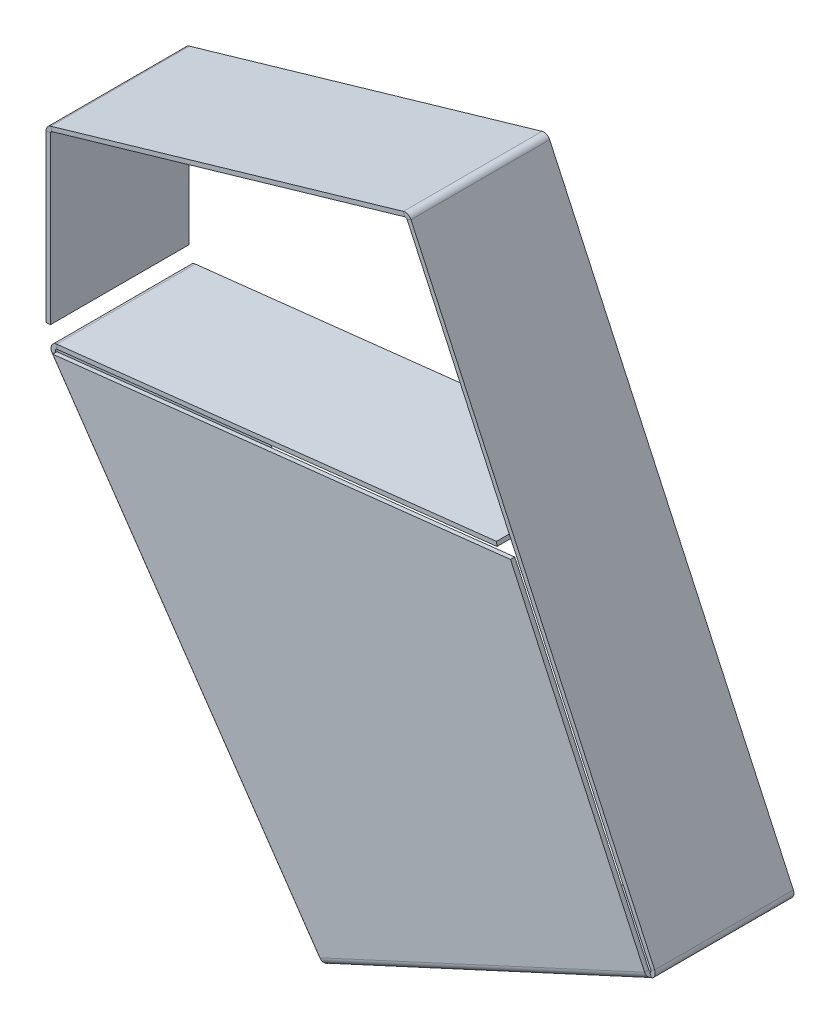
ISO-10303-21;
HEADER;
FILE_DESCRIPTION(('STEP AP214'),'2;1');
FILE_NAME('part.step','',(''),(''),'','','');
FILE_SCHEMA(('AUTOMOTIVE_DESIGN { 1 0 10303 214 1 1 1 1 }'));
ENDSEC;
DATA;
#1=APPLICATION_CONTEXT('core data for automotive mechanical design processes');
#2=APPLICATION_PROTOCOL_DEFINITION('international standard','automotive_design',2000,#1);
#3=PRODUCT_CONTEXT('',#1,'mechanical');
#4=PRODUCT('Part','Part','',(#3));
#5=PRODUCT_RELATED_PRODUCT_CATEGORY('part','',(#4));
#6=PRODUCT_DEFINITION_FORMATION('','',#4);
#7=PRODUCT_DEFINITION_CONTEXT('part definition',#1,'design');
#8=PRODUCT_DEFINITION('design','',#6,#7);
#9=PRODUCT_DEFINITION_SHAPE('','',#8);
#10=(LENGTH_UNIT() NAMED_UNIT(*) SI_UNIT(.MILLI.,.METRE.));
#11=(NAMED_UNIT(*) PLANE_ANGLE_UNIT() SI_UNIT($,.RADIAN.));
#12=(NAMED_UNIT(*) SI_UNIT($,.STERADIAN.) SOLID_ANGLE_UNIT());
#13=UNCERTAINTY_MEASURE_WITH_UNIT(LENGTH_MEASURE(1.E-05),#10,'distance_accuracy_value','');
#14=(GEOMETRIC_REPRESENTATION_CONTEXT(3) GLOBAL_UNCERTAINTY_ASSIGNED_CONTEXT((#13)) GLOBAL_UNIT_ASSIGNED_CONTEXT((#10,
#11,#12)) REPRESENTATION_CONTEXT('',''));
#15=CARTESIAN_POINT('',(0.,0.,0.));
#16=DIRECTION('',(0.,0.,1.));
#17=DIRECTION('',(1.,0.,0.));
#18=AXIS2_PLACEMENT_3D('',#15,#16,#17);
#19=CARTESIAN_POINT('',(282.950509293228,-122.463573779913,0.));
#20=DIRECTION('',(-0.907959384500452,-0.419058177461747,0.));
#21=DIRECTION('',(0.419058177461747,-0.907959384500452,0.));
#22=AXIS2_PLACEMENT_3D('',#19,#20,#21);
#23=PLANE('',#22);
#24=DIRECTION('',(-0.419058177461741,0.907959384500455,0.));
#25=VECTOR('',#24,1.);
#26=CARTESIAN_POINT('',(283.788625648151,-124.279492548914,0.));
#27=LINE('',#26,#25);
#28=CARTESIAN_POINT('',(283.788625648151,-124.279492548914,0.));
#29=VERTEX_POINT('',#28);
#30=CARTESIAN_POINT('',(283.716726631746,-124.123711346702,0.));
#31=VERTEX_POINT('',#30);
#32=EDGE_CURVE('E392',#29,#31,#27,.T.);
#33=ORIENTED_EDGE('',*,*,#32,.T.);
#34=CARTESIAN_POINT('',(282.531451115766,-121.555614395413,-0.999999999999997));
#35=DIRECTION('',(0.907959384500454,0.419058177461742,0.));
#36=DIRECTION('',(-0.419058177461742,0.907959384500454,0.));
#37=AXIS2_PLACEMENT_3D('',#34,#35,#36);
#38=CIRCLE('',#37,3.);
#39=CARTESIAN_POINT('',(283.788625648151,-124.279492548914,-0.999999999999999));
#40=VERTEX_POINT('',#39);
#41=EDGE_CURVE('E11',#31,#40,#38,.T.);
#42=ORIENTED_EDGE('',*,*,#41,.T.);
#43=DIRECTION('',(0.,0.,1.));
#44=VECTOR('',#43,1.);
#45=CARTESIAN_POINT('',(283.788625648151,-124.279492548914,-65.));
#46=LINE('',#45,#44);
#47=EDGE_CURVE('E364',#40,#29,#46,.T.);
#48=ORIENTED_EDGE('',*,*,#47,.T.);
#49=EDGE_LOOP('',(#33,#42,#48));
#50=FACE_BOUND('',#49,.T.);
#51=ADVANCED_FACE('F35',(#50),#23,.T.);
#52=CARTESIAN_POINT('',(285.674387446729,-121.206399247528,-65.));
#53=DIRECTION('',(-0.419058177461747,0.907959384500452,0.));
#54=DIRECTION('',(-0.907959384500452,-0.419058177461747,0.));
#55=AXIS2_PLACEMENT_3D('',#52,#53,#54);
#56=PLANE('',#55);
#57=DIRECTION('',(0.,0.,1.));
#58=VECTOR('',#57,1.);
#59=CARTESIAN_POINT('',(130.917562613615,-192.63262609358,-65.));
#60=LINE('',#59,#58);
#61=CARTESIAN_POINT('',(130.917562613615,-192.63262609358,-65.));
#62=VERTEX_POINT('',#61);
#63=CARTESIAN_POINT('',(130.917562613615,-192.63262609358,-0.999999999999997));
#64=VERTEX_POINT('',#63);
#65=EDGE_CURVE('E237',#62,#64,#60,.T.);
#66=ORIENTED_EDGE('',*,*,#65,.T.);
#67=DIRECTION('',(0.907959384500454,0.419058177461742,0.));
#68=VECTOR('',#67,1.);
#69=CARTESIAN_POINT('',(282.950509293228,-122.463573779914,-0.999999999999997));
#70=LINE('',#69,#68);
#71=CARTESIAN_POINT('',(282.950509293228,-122.463573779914,-0.999999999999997));
#72=VERTEX_POINT('',#71);
#73=EDGE_CURVE('E620',#72,#64,#70,.F.);
#74=ORIENTED_EDGE('',*,*,#73,.F.);
#75=DIRECTION('',(0.,0.,1.));
#76=VECTOR('',#75,1.);
#77=CARTESIAN_POINT('',(282.950509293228,-122.463573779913,-65.));
#78=LINE('',#77,#76);
#79=CARTESIAN_POINT('',(282.950509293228,-122.463573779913,-65.));
#80=VERTEX_POINT('',#79);
#81=EDGE_CURVE('E323',#80,#72,#78,.T.);
#82=ORIENTED_EDGE('',*,*,#81,.F.);
#83=DIRECTION('',(-0.907959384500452,-0.419058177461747,0.));
#84=VECTOR('',#83,1.);
#85=CARTESIAN_POINT('',(285.674387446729,-121.206399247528,-65.));
#86=LINE('',#85,#84);
#87=EDGE_CURVE('E248',#80,#62,#86,.T.);
#88=ORIENTED_EDGE('',*,*,#87,.T.);
#89=EDGE_LOOP('',(#66,#74,#82,#88));
#90=FACE_BOUND('',#89,.T.);
#91=ADVANCED_FACE('F661',(#90),#56,.T.);
#92=CARTESIAN_POINT('',(286.512503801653,-123.022318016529,-65.));
#93=DIRECTION('',(-0.419058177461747,0.907959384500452,0.));
#94=DIRECTION('',(-0.907959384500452,-0.419058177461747,0.));
#95=AXIS2_PLACEMENT_3D('',#92,#93,#94);
#96=PLANE('',#95);
#97=DIRECTION('',(0.907959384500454,0.419058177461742,0.));
#98=VECTOR('',#97,1.);
#99=CARTESIAN_POINT('',(283.788625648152,-124.279492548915,-0.999999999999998));
#100=LINE('',#99,#98);
#101=CARTESIAN_POINT('',(131.755678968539,-194.448544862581,-0.999999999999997));
#102=VERTEX_POINT('',#101);
#103=EDGE_CURVE('E576',#40,#102,#100,.F.);
#104=ORIENTED_EDGE('',*,*,#103,.T.);
#105=DIRECTION('',(0.,0.,1.));
#106=VECTOR('',#105,1.);
#107=CARTESIAN_POINT('',(131.755678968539,-194.448544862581,-65.));
#108=LINE('',#107,#106);
#109=CARTESIAN_POINT('',(131.755678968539,-194.448544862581,-65.));
#110=VERTEX_POINT('',#109);
#111=EDGE_CURVE('E365',#110,#102,#108,.T.);
#112=ORIENTED_EDGE('',*,*,#111,.F.);
#113=DIRECTION('',(-0.907959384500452,-0.419058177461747,0.));
#114=VECTOR('',#113,1.);
#115=CARTESIAN_POINT('',(286.512503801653,-123.022318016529,-65.));
#116=LINE('',#115,#114);
#117=CARTESIAN_POINT('',(283.788625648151,-124.279492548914,-65.));
#118=VERTEX_POINT('',#117);
#119=EDGE_CURVE('E1275',#118,#110,#116,.T.);
#120=ORIENTED_EDGE('',*,*,#119,.F.);
#121=EDGE_CURVE('E361',#118,#40,#46,.T.);
#122=ORIENTED_EDGE('',*,*,#121,.T.);
#123=EDGE_LOOP('',(#104,#112,#120,#122));
#124=FACE_BOUND('',#123,.T.);
#125=ADVANCED_FACE('F680',(#124),#96,.F.);
#126=CARTESIAN_POINT('',(0.,77.8184908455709,-65.));
#127=DIRECTION('',(0.,0.,-1.));
#128=DIRECTION('',(-1.,0.,0.));
#129=AXIS2_PLACEMENT_3D('',#126,#127,#128);
#130=PLANE('',#129);
#131=DIRECTION('',(1.,0.,0.));
#132=VECTOR('',#131,1.);
#133=CARTESIAN_POINT('',(0.,77.8184908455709,-65.));
#134=LINE('',#133,#132);
#135=CARTESIAN_POINT('',(0.,77.8184908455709,-65.));
#136=VERTEX_POINT('',#135);
#137=CARTESIAN_POINT('',(2.,77.8184908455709,-65.));
#138=VERTEX_POINT('',#137);
#139=EDGE_CURVE('E39',#136,#138,#134,.T.);
#140=ORIENTED_EDGE('',*,*,#139,.F.);
#141=CARTESIAN_POINT('',(3.,77.8184908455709,-65.));
#142=DIRECTION('',(0.,0.,1.));
#143=DIRECTION('',(1.,0.,0.));
#144=AXIS2_PLACEMENT_3D('',#141,#142,#143);
#145=CIRCLE('',#144,3.);
#146=CARTESIAN_POINT('',(2.16228563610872,80.6991565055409,-65.));
#147=VERTEX_POINT('',#146);
#148=EDGE_CURVE('E487',#136,#147,#145,.F.);
#149=ORIENTED_EDGE('',*,*,#148,.T.);
#150=DIRECTION('',(-0.279238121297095,0.960221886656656,0.));
#151=VECTOR('',#150,1.);
#152=CARTESIAN_POINT('',(2.72076187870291,78.7787127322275,-65.));
#153=LINE('',#152,#151);
#154=CARTESIAN_POINT('',(2.72076187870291,78.7787127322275,-65.));
#155=VERTEX_POINT('',#154);
#156=EDGE_CURVE('E409',#155,#147,#153,.T.);
#157=ORIENTED_EDGE('',*,*,#156,.F.);
#158=CARTESIAN_POINT('',(3.,77.8184908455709,-65.));
#159=DIRECTION('',(0.,0.,1.));
#160=DIRECTION('',(1.,0.,0.));
#161=AXIS2_PLACEMENT_3D('',#158,#159,#160);
#162=CIRCLE('',#161,1.);
#163=EDGE_CURVE('E430',#138,#155,#162,.F.);
#164=ORIENTED_EDGE('',*,*,#163,.F.);
#165=EDGE_LOOP('',(#140,#149,#157,#164));
#166=FACE_BOUND('',#165,.T.);
#167=ADVANCED_FACE('F37',(#166),#130,.T.);
#168=CARTESIAN_POINT('',(2.72076187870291,78.7787127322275,-65.));
#169=DIRECTION('',(0.,0.,-1.));
#170=DIRECTION('',(-1.,0.,0.));
#171=AXIS2_PLACEMENT_3D('',#168,#169,#170);
#172=PLANE('',#171);
#173=DIRECTION('',(0.,1.,0.));
#174=VECTOR('',#173,1.);
#175=CARTESIAN_POINT('',(0.,0.,-65.));
#176=LINE('',#175,#174);
#177=CARTESIAN_POINT('',(0.,0.,-65.));
#178=VERTEX_POINT('',#177);
#179=EDGE_CURVE('E422',#178,#136,#176,.T.);
#180=ORIENTED_EDGE('',*,*,#179,.T.);
#181=ORIENTED_EDGE('',*,*,#139,.T.);
#182=DIRECTION('',(0.,1.,0.));
#183=VECTOR('',#182,1.);
#184=CARTESIAN_POINT('',(2.,0.,-65.));
#185=LINE('',#184,#183);
#186=CARTESIAN_POINT('',(2.,0.,-65.));
#187=VERTEX_POINT('',#186);
#188=EDGE_CURVE('E420',#187,#138,#185,.T.);
#189=ORIENTED_EDGE('',*,*,#188,.F.);
#190=DIRECTION('',(-1.,0.,0.));
#191=VECTOR('',#190,1.);
#192=CARTESIAN_POINT('',(2.,0.,-65.));
#193=LINE('',#192,#191);
#194=EDGE_CURVE('E438',#187,#178,#193,.T.);
#195=ORIENTED_EDGE('',*,*,#194,.T.);
#196=EDGE_LOOP('',(#180,#181,#189,#195));
#197=FACE_BOUND('',#196,.T.);
#198=ADVANCED_FACE('F418',(#197),#172,.T.);
#199=CARTESIAN_POINT('',(2.16228563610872,80.6991565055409,0.));
#200=DIRECTION('',(0.,0.,1.));
#201=DIRECTION('',(1.,0.,0.));
#202=AXIS2_PLACEMENT_3D('',#199,#200,#201);
#203=PLANE('',#202);
#204=DIRECTION('',(0.279238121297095,-0.960221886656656,0.));
#205=VECTOR('',#204,1.);
#206=CARTESIAN_POINT('',(2.16228563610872,80.6991565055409,0.));
#207=LINE('',#206,#205);
#208=CARTESIAN_POINT('',(2.16228563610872,80.6991565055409,0.));
#209=VERTEX_POINT('',#208);
#210=CARTESIAN_POINT('',(2.72076187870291,78.7787127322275,0.));
#211=VERTEX_POINT('',#210);
#212=EDGE_CURVE('E408',#209,#211,#207,.T.);
#213=ORIENTED_EDGE('',*,*,#212,.F.);
#214=CARTESIAN_POINT('',(3.,77.8184908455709,0.));
#215=DIRECTION('',(0.,0.,1.));
#216=DIRECTION('',(1.,0.,0.));
#217=AXIS2_PLACEMENT_3D('',#214,#215,#216);
#218=CIRCLE('',#217,3.);
#219=CARTESIAN_POINT('',(0.,77.8184908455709,0.));
#220=VERTEX_POINT('',#219);
#221=EDGE_CURVE('E286',#220,#209,#218,.F.);
#222=ORIENTED_EDGE('',*,*,#221,.F.);
#223=DIRECTION('',(-1.,0.,0.));
#224=VECTOR('',#223,1.);
#225=CARTESIAN_POINT('',(2.,77.8184908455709,0.));
#226=LINE('',#225,#224);
#227=CARTESIAN_POINT('',(2.,77.8184908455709,0.));
#228=VERTEX_POINT('',#227);
#229=EDGE_CURVE('E406',#228,#220,#226,.T.);
#230=ORIENTED_EDGE('',*,*,#229,.F.);
#231=CARTESIAN_POINT('',(3.,77.8184908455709,0.));
#232=DIRECTION('',(0.,0.,1.));
#233=DIRECTION('',(1.,0.,0.));
#234=AXIS2_PLACEMENT_3D('',#231,#232,#233);
#235=CIRCLE('',#234,1.);
#236=EDGE_CURVE('E297',#228,#211,#235,.F.);
#237=ORIENTED_EDGE('',*,*,#236,.T.);
#238=EDGE_LOOP('',(#213,#222,#230,#237));
#239=FACE_BOUND('',#238,.T.);
#240=ADVANCED_FACE('F779',(#239),#203,.T.);
#241=CARTESIAN_POINT('',(2.,77.8184908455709,0.));
#242=DIRECTION('',(0.,0.,1.));
#243=DIRECTION('',(1.,0.,0.));
#244=AXIS2_PLACEMENT_3D('',#241,#242,#243);
#245=PLANE('',#244);
#246=DIRECTION('',(0.960221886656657,0.279238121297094,0.));
#247=VECTOR('',#246,1.);
#248=CARTESIAN_POINT('',(0.,80.0703512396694,0.));
#249=LINE('',#248,#247);
#250=CARTESIAN_POINT('',(167.485548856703,128.77612503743,0.));
#251=VERTEX_POINT('',#250);
#252=EDGE_CURVE('E283',#209,#251,#249,.T.);
#253=ORIENTED_EDGE('',*,*,#252,.F.);
#254=ORIENTED_EDGE('',*,*,#212,.T.);
#255=DIRECTION('',(0.960221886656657,0.279238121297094,0.));
#256=VECTOR('',#255,1.);
#257=CARTESIAN_POINT('',(0.558476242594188,78.1499074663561,0.));
#258=LINE('',#257,#256);
#259=CARTESIAN_POINT('',(168.044025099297,126.855681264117,0.));
#260=VERTEX_POINT('',#259);
#261=EDGE_CURVE('E300',#211,#260,#258,.T.);
#262=ORIENTED_EDGE('',*,*,#261,.T.);
#263=DIRECTION('',(-0.27923812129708,0.960221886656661,0.));
#264=VECTOR('',#263,1.);
#265=CARTESIAN_POINT('',(168.044025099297,126.855681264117,0.));
#266=LINE('',#265,#264);
#267=EDGE_CURVE('E398',#260,#251,#266,.T.);
#268=ORIENTED_EDGE('',*,*,#267,.T.);
#269=EDGE_LOOP('',(#253,#254,#262,#268));
#270=FACE_BOUND('',#269,.T.);
#271=ADVANCED_FACE('F510',(#270),#245,.T.);
#272=CARTESIAN_POINT('',(167.485548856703,128.77612503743,-65.));
#273=DIRECTION('',(0.,0.,-1.));
#274=DIRECTION('',(-1.,0.,0.));
#275=AXIS2_PLACEMENT_3D('',#272,#273,#274);
#276=PLANE('',#275);
#277=DIRECTION('',(0.27923812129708,-0.960221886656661,0.));
#278=VECTOR('',#277,1.);
#279=CARTESIAN_POINT('',(167.485548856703,128.77612503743,-65.));
#280=LINE('',#279,#278);
#281=CARTESIAN_POINT('',(167.485548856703,128.77612503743,-65.));
#282=VERTEX_POINT('',#281);
#283=CARTESIAN_POINT('',(168.044025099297,126.855681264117,-65.));
#284=VERTEX_POINT('',#283);
#285=EDGE_CURVE('E404',#282,#284,#280,.T.);
#286=ORIENTED_EDGE('',*,*,#285,.F.);
#287=CARTESIAN_POINT('',(168.323263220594,125.89545937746,-65.));
#288=DIRECTION('',(0.,0.,1.));
#289=DIRECTION('',(1.,0.,0.));
#290=AXIS2_PLACEMENT_3D('',#287,#288,#289);
#291=CIRCLE('',#290,3.);
#292=CARTESIAN_POINT('',(171.047141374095,127.152633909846,-65.));
#293=VERTEX_POINT('',#292);
#294=EDGE_CURVE('E488',#282,#293,#291,.F.);
#295=ORIENTED_EDGE('',*,*,#294,.T.);
#296=DIRECTION('',(0.907959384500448,0.419058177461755,0.));
#297=VECTOR('',#296,1.);
#298=CARTESIAN_POINT('',(169.231222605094,126.314517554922,-65.));
#299=LINE('',#298,#297);
#300=CARTESIAN_POINT('',(169.231222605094,126.314517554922,-65.));
#301=VERTEX_POINT('',#300);
#302=EDGE_CURVE('E402',#301,#293,#299,.T.);
#303=ORIENTED_EDGE('',*,*,#302,.F.);
#304=CARTESIAN_POINT('',(168.323263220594,125.89545937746,-65.));
#305=DIRECTION('',(0.,0.,1.));
#306=DIRECTION('',(1.,0.,0.));
#307=AXIS2_PLACEMENT_3D('',#304,#305,#306);
#308=CIRCLE('',#307,1.);
#309=EDGE_CURVE('E445',#284,#301,#308,.F.);
#310=ORIENTED_EDGE('',*,*,#309,.F.);
#311=EDGE_LOOP('',(#286,#295,#303,#310));
#312=FACE_BOUND('',#311,.T.);
#313=ADVANCED_FACE('F478',(#312),#276,.T.);
#314=CARTESIAN_POINT('',(169.231222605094,126.314517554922,-65.));
#315=DIRECTION('',(0.,0.,-1.));
#316=DIRECTION('',(-1.,0.,0.));
#317=AXIS2_PLACEMENT_3D('',#314,#315,#316);
#318=PLANE('',#317);
#319=DIRECTION('',(0.960221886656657,0.279238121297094,0.));
#320=VECTOR('',#319,1.);
#321=CARTESIAN_POINT('',(0.,80.0703512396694,-65.));
#322=LINE('',#321,#320);
#323=EDGE_CURVE('E484',#147,#282,#322,.T.);
#324=ORIENTED_EDGE('',*,*,#323,.T.);
#325=ORIENTED_EDGE('',*,*,#285,.T.);
#326=DIRECTION('',(0.960221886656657,0.279238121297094,0.));
#327=VECTOR('',#326,1.);
#328=CARTESIAN_POINT('',(0.558476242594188,78.1499074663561,-65.));
#329=LINE('',#328,#327);
#330=EDGE_CURVE('E434',#155,#284,#329,.T.);
#331=ORIENTED_EDGE('',*,*,#330,.F.);
#332=ORIENTED_EDGE('',*,*,#156,.T.);
#333=EDGE_LOOP('',(#324,#325,#331,#332));
#334=FACE_BOUND('',#333,.T.);
#335=ADVANCED_FACE('F482',(#334),#318,.T.);
#336=CARTESIAN_POINT('',(171.047141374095,127.152633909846,0.));
#337=DIRECTION('',(0.,0.,1.));
#338=DIRECTION('',(1.,0.,0.));
#339=AXIS2_PLACEMENT_3D('',#336,#337,#338);
#340=PLANE('',#339);
#341=DIRECTION('',(-0.907959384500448,-0.419058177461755,0.));
#342=VECTOR('',#341,1.);
#343=CARTESIAN_POINT('',(171.047141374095,127.152633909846,0.));
#344=LINE('',#343,#342);
#345=CARTESIAN_POINT('',(171.047141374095,127.152633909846,0.));
#346=VERTEX_POINT('',#345);
#347=CARTESIAN_POINT('',(169.231222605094,126.314517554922,0.));
#348=VERTEX_POINT('',#347);
#349=EDGE_CURVE('E400',#346,#348,#344,.T.);
#350=ORIENTED_EDGE('',*,*,#349,.F.);
#351=CARTESIAN_POINT('',(168.323263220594,125.89545937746,0.));
#352=DIRECTION('',(0.,0.,1.));
#353=DIRECTION('',(1.,0.,0.));
#354=AXIS2_PLACEMENT_3D('',#351,#352,#353);
#355=CIRCLE('',#354,3.);
#356=EDGE_CURVE('E280',#251,#346,#355,.F.);
#357=ORIENTED_EDGE('',*,*,#356,.F.);
#358=ORIENTED_EDGE('',*,*,#267,.F.);
#359=CARTESIAN_POINT('',(168.323263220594,125.89545937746,0.));
#360=DIRECTION('',(0.,0.,1.));
#361=DIRECTION('',(1.,0.,0.));
#362=AXIS2_PLACEMENT_3D('',#359,#360,#361);
#363=CIRCLE('',#362,1.);
#364=EDGE_CURVE('E303',#260,#348,#363,.F.);
#365=ORIENTED_EDGE('',*,*,#364,.T.);
#366=EDGE_LOOP('',(#350,#357,#358,#365));
#367=FACE_BOUND('',#366,.T.);
#368=ADVANCED_FACE('F512',(#367),#340,.T.);
#369=CARTESIAN_POINT('',(168.044025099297,126.855681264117,0.));
#370=DIRECTION('',(0.,0.,1.));
#371=DIRECTION('',(1.,0.,0.));
#372=AXIS2_PLACEMENT_3D('',#369,#370,#371);
#373=PLANE('',#372);
#374=DIRECTION('',(0.419058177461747,-0.907959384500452,0.));
#375=VECTOR('',#374,1.);
#376=CARTESIAN_POINT('',(169.965044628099,129.497176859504,0.));
#377=LINE('',#376,#375);
#378=CARTESIAN_POINT('',(285.255329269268,-120.298439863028,0.));
#379=VERTEX_POINT('',#378);
#380=EDGE_CURVE('E277',#346,#379,#377,.T.);
#381=ORIENTED_EDGE('',*,*,#380,.F.);
#382=ORIENTED_EDGE('',*,*,#349,.T.);
#383=DIRECTION('',(0.419058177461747,-0.907959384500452,0.));
#384=VECTOR('',#383,1.);
#385=CARTESIAN_POINT('',(168.149125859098,128.659060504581,0.));
#386=LINE('',#385,#384);
#387=CARTESIAN_POINT('',(283.439410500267,-121.136556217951,0.));
#388=VERTEX_POINT('',#387);
#389=EDGE_CURVE('E306',#348,#388,#386,.T.);
#390=ORIENTED_EDGE('',*,*,#389,.T.);
#391=DIRECTION('',(0.907959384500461,0.419058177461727,0.));
#392=VECTOR('',#391,1.);
#393=CARTESIAN_POINT('',(283.439410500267,-121.136556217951,0.));
#394=LINE('',#393,#392);
#395=EDGE_CURVE('E390',#388,#379,#394,.T.);
#396=ORIENTED_EDGE('',*,*,#395,.T.);
#397=EDGE_LOOP('',(#381,#382,#390,#396));
#398=FACE_BOUND('',#397,.T.);
#399=ADVANCED_FACE('F518',(#398),#373,.T.);
#400=CARTESIAN_POINT('',(285.255329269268,-120.298439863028,-65.));
#401=DIRECTION('',(0.,0.,-1.));
#402=DIRECTION('',(-1.,0.,0.));
#403=AXIS2_PLACEMENT_3D('',#400,#401,#402);
#404=PLANE('',#403);
#405=DIRECTION('',(-0.907959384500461,-0.419058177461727,0.));
#406=VECTOR('',#405,1.);
#407=CARTESIAN_POINT('',(285.255329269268,-120.298439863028,-65.));
#408=LINE('',#407,#406);
#409=CARTESIAN_POINT('',(285.255329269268,-120.298439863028,-65.));
#410=VERTEX_POINT('',#409);
#411=CARTESIAN_POINT('',(283.439410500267,-121.136556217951,-65.));
#412=VERTEX_POINT('',#411);
#413=EDGE_CURVE('E396',#410,#412,#408,.T.);
#414=ORIENTED_EDGE('',*,*,#413,.F.);
#415=CARTESIAN_POINT('',(282.531451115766,-121.555614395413,-65.));
#416=DIRECTION('',(0.,0.,1.));
#417=DIRECTION('',(1.,0.,0.));
#418=AXIS2_PLACEMENT_3D('',#415,#416,#417);
#419=CIRCLE('',#418,3.);
#420=EDGE_CURVE('E500',#410,#118,#419,.F.);
#421=ORIENTED_EDGE('',*,*,#420,.T.);
#422=DIRECTION('',(0.419058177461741,-0.907959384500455,0.));
#423=VECTOR('',#422,1.);
#424=CARTESIAN_POINT('',(282.950509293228,-122.463573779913,-65.));
#425=LINE('',#424,#423);
#426=EDGE_CURVE('E394',#80,#118,#425,.T.);
#427=ORIENTED_EDGE('',*,*,#426,.F.);
#428=CARTESIAN_POINT('',(282.531451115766,-121.555614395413,-65.));
#429=DIRECTION('',(0.,0.,1.));
#430=DIRECTION('',(1.,0.,0.));
#431=AXIS2_PLACEMENT_3D('',#428,#429,#430);
#432=CIRCLE('',#431,1.);
#433=EDGE_CURVE('E250',#412,#80,#432,.F.);
#434=ORIENTED_EDGE('',*,*,#433,.F.);
#435=EDGE_LOOP('',(#414,#421,#427,#434));
#436=FACE_BOUND('',#435,.T.);
#437=ADVANCED_FACE('F461',(#436),#404,.T.);
#438=CARTESIAN_POINT('',(282.950509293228,-122.463573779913,-65.));
#439=DIRECTION('',(0.,0.,-1.));
#440=DIRECTION('',(-1.,0.,0.));
#441=AXIS2_PLACEMENT_3D('',#438,#439,#440);
#442=PLANE('',#441);
#443=DIRECTION('',(0.419058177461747,-0.907959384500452,0.));
#444=VECTOR('',#443,1.);
#445=CARTESIAN_POINT('',(169.965044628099,129.497176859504,-65.));
#446=LINE('',#445,#444);
#447=EDGE_CURVE('E498',#293,#410,#446,.T.);
#448=ORIENTED_EDGE('',*,*,#447,.T.);
#449=ORIENTED_EDGE('',*,*,#413,.T.);
#450=DIRECTION('',(0.419058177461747,-0.907959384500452,0.));
#451=VECTOR('',#450,1.);
#452=CARTESIAN_POINT('',(168.149125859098,128.659060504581,-65.));
#453=LINE('',#452,#451);
#454=EDGE_CURVE('E448',#301,#412,#453,.T.);
#455=ORIENTED_EDGE('',*,*,#454,.F.);
#456=ORIENTED_EDGE('',*,*,#302,.T.);
#457=EDGE_LOOP('',(#448,#449,#455,#456));
#458=FACE_BOUND('',#457,.T.);
#459=ADVANCED_FACE('F470',(#458),#442,.T.);
#460=CARTESIAN_POINT('',(283.788625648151,-124.279492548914,0.));
#461=DIRECTION('',(0.,0.,1.));
#462=DIRECTION('',(1.,0.,0.));
#463=AXIS2_PLACEMENT_3D('',#460,#461,#462);
#464=PLANE('',#463);
#465=ORIENTED_EDGE('',*,*,#32,.F.);
#466=CARTESIAN_POINT('',(282.531451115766,-121.555614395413,0.));
#467=DIRECTION('',(0.,0.,1.));
#468=DIRECTION('',(1.,0.,0.));
#469=AXIS2_PLACEMENT_3D('',#466,#467,#468);
#470=CIRCLE('',#469,3.);
#471=EDGE_CURVE('E274',#379,#29,#470,.F.);
#472=ORIENTED_EDGE('',*,*,#471,.F.);
#473=ORIENTED_EDGE('',*,*,#395,.F.);
#474=CARTESIAN_POINT('',(282.531451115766,-121.555614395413,0.));
#475=DIRECTION('',(0.,0.,1.));
#476=DIRECTION('',(1.,0.,0.));
#477=AXIS2_PLACEMENT_3D('',#474,#475,#476);
#478=CIRCLE('',#477,1.);
#479=CARTESIAN_POINT('',(282.950509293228,-122.463573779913,0.));
#480=VERTEX_POINT('',#479);
#481=EDGE_CURVE('E309',#388,#480,#478,.F.);
#482=ORIENTED_EDGE('',*,*,#481,.T.);
#483=EDGE_CURVE('E52',#31,#480,#27,.T.);
#484=ORIENTED_EDGE('',*,*,#483,.F.);
#485=EDGE_LOOP('',(#465,#472,#473,#482,#484));
#486=FACE_BOUND('',#485,.T.);
#487=ADVANCED_FACE('F520',(#486),#464,.T.);
#488=CARTESIAN_POINT('',(131.755678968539,-194.448544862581,-65.));
#489=DIRECTION('',(0.,0.,-1.));
#490=DIRECTION('',(-1.,0.,0.));
#491=AXIS2_PLACEMENT_3D('',#488,#489,#490);
#492=PLANE('',#491);
#493=DIRECTION('',(-0.419058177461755,0.907959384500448,0.));
#494=VECTOR('',#493,1.);
#495=CARTESIAN_POINT('',(131.755678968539,-194.448544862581,-65.));
#496=LINE('',#495,#494);
#497=EDGE_CURVE('E220',#110,#62,#496,.T.);
#498=ORIENTED_EDGE('',*,*,#497,.F.);
#499=CARTESIAN_POINT('',(130.498504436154,-191.72466670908,-65.));
#500=DIRECTION('',(0.,0.,1.));
#501=DIRECTION('',(1.,0.,0.));
#502=AXIS2_PLACEMENT_3D('',#499,#500,#501);
#503=CIRCLE('',#502,3.);
#504=CARTESIAN_POINT('',(128.025243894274,-193.422601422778,-65.));
#505=VERTEX_POINT('',#504);
#506=EDGE_CURVE('E215',#110,#505,#503,.F.);
#507=ORIENTED_EDGE('',*,*,#506,.T.);
#508=DIRECTION('',(-0.824420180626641,-0.565978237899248,0.));
#509=VECTOR('',#508,1.);
#510=CARTESIAN_POINT('',(129.674084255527,-192.290644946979,-65.));
#511=LINE('',#510,#509);
#512=CARTESIAN_POINT('',(129.674084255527,-192.290644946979,-65.));
#513=VERTEX_POINT('',#512);
#514=EDGE_CURVE('E208',#513,#505,#511,.T.);
#515=ORIENTED_EDGE('',*,*,#514,.F.);
#516=CARTESIAN_POINT('',(130.498504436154,-191.72466670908,-65.));
#517=DIRECTION('',(0.,0.,1.));
#518=DIRECTION('',(1.,0.,0.));
#519=AXIS2_PLACEMENT_3D('',#516,#517,#518);
#520=CIRCLE('',#519,1.);
#521=EDGE_CURVE('E212',#62,#513,#520,.F.);
#522=ORIENTED_EDGE('',*,*,#521,.F.);
#523=EDGE_LOOP('',(#498,#507,#515,#522));
#524=FACE_BOUND('',#523,.T.);
#525=ADVANCED_FACE('F210',(#524),#492,.T.);
#526=CARTESIAN_POINT('',(129.674084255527,-192.290644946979,-65.));
#527=DIRECTION('',(0.,0.,-1.));
#528=DIRECTION('',(-1.,0.,0.));
#529=AXIS2_PLACEMENT_3D('',#526,#527,#528);
#530=PLANE('',#529);
#531=ORIENTED_EDGE('',*,*,#119,.T.);
#532=ORIENTED_EDGE('',*,*,#497,.T.);
#533=ORIENTED_EDGE('',*,*,#87,.F.);
#534=ORIENTED_EDGE('',*,*,#426,.T.);
#535=EDGE_LOOP('',(#531,#532,#533,#534));
#536=FACE_BOUND('',#535,.T.);
#537=ADVANCED_FACE('F756',(#536),#530,.T.);
#538=CARTESIAN_POINT('',(128.025243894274,-193.422601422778,0.));
#539=DIRECTION('',(0.,0.,1.));
#540=DIRECTION('',(1.,0.,0.));
#541=AXIS2_PLACEMENT_3D('',#538,#539,#540);
#542=PLANE('',#541);
#543=DIRECTION('',(0.824420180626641,0.565978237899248,0.));
#544=VECTOR('',#543,1.);
#545=CARTESIAN_POINT('',(128.025243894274,-193.422601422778,0.));
#546=LINE('',#545,#544);
#547=CARTESIAN_POINT('',(128.025243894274,-193.422601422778,0.));
#548=VERTEX_POINT('',#547);
#549=CARTESIAN_POINT('',(129.674084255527,-192.290644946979,0.));
#550=VERTEX_POINT('',#549);
#551=EDGE_CURVE('E221',#548,#550,#546,.T.);
#552=ORIENTED_EDGE('',*,*,#551,.F.);
#553=CARTESIAN_POINT('',(130.498504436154,-191.72466670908,0.));
#554=DIRECTION('',(0.,0.,1.));
#555=DIRECTION('',(1.,0.,0.));
#556=AXIS2_PLACEMENT_3D('',#553,#554,#555);
#557=CIRCLE('',#556,3.);
#558=CARTESIAN_POINT('',(131.755678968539,-194.448544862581,0.));
#559=VERTEX_POINT('',#558);
#560=EDGE_CURVE('E271',#559,#548,#557,.F.);
#561=ORIENTED_EDGE('',*,*,#560,.F.);
#562=DIRECTION('',(0.419058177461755,-0.907959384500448,0.));
#563=VECTOR('',#562,1.);
#564=CARTESIAN_POINT('',(130.917562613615,-192.63262609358,0.));
#565=LINE('',#564,#563);
#566=CARTESIAN_POINT('',(130.917562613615,-192.63262609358,0.));
#567=VERTEX_POINT('',#566);
#568=EDGE_CURVE('E386',#567,#559,#565,.T.);
#569=ORIENTED_EDGE('',*,*,#568,.F.);
#570=CARTESIAN_POINT('',(130.498504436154,-191.72466670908,0.));
#571=DIRECTION('',(0.,0.,1.));
#572=DIRECTION('',(1.,0.,0.));
#573=AXIS2_PLACEMENT_3D('',#570,#571,#572);
#574=CIRCLE('',#573,1.);
#575=EDGE_CURVE('E311',#567,#550,#574,.F.);
#576=ORIENTED_EDGE('',*,*,#575,.T.);
#577=EDGE_LOOP('',(#552,#561,#569,#576));
#578=FACE_BOUND('',#577,.T.);
#579=ADVANCED_FACE('F752',(#578),#542,.T.);
#580=CARTESIAN_POINT('',(130.917562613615,-192.63262609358,0.));
#581=DIRECTION('',(0.,0.,1.));
#582=DIRECTION('',(1.,0.,0.));
#583=AXIS2_PLACEMENT_3D('',#580,#581,#582);
#584=PLANE('',#583);
#585=DIRECTION('',(-0.565978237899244,0.824420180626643,0.));
#586=VECTOR('',#585,1.);
#587=CARTESIAN_POINT('',(129.457696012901,-195.509152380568,0.));
#588=LINE('',#587,#586);
#589=CARTESIAN_POINT('',(2.83118658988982,-11.0613365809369,0.));
#590=VERTEX_POINT('',#589);
#591=EDGE_CURVE('E268',#548,#590,#588,.T.);
#592=ORIENTED_EDGE('',*,*,#591,.F.);
#593=ORIENTED_EDGE('',*,*,#551,.T.);
#594=DIRECTION('',(-0.565978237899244,0.824420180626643,0.));
#595=VECTOR('',#594,1.);
#596=CARTESIAN_POINT('',(131.106536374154,-194.37719590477,0.));
#597=LINE('',#596,#595);
#598=CARTESIAN_POINT('',(4.48002695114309,-9.92938010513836,0.));
#599=VERTEX_POINT('',#598);
#600=EDGE_CURVE('E232',#550,#599,#597,.T.);
#601=ORIENTED_EDGE('',*,*,#600,.T.);
#602=DIRECTION('',(-0.824420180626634,-0.565978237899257,0.));
#603=VECTOR('',#602,1.);
#604=CARTESIAN_POINT('',(4.48002695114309,-9.92938010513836,0.));
#605=LINE('',#604,#603);
#606=EDGE_CURVE('E320',#599,#590,#605,.T.);
#607=ORIENTED_EDGE('',*,*,#606,.T.);
#608=EDGE_LOOP('',(#592,#593,#601,#607));
#609=FACE_BOUND('',#608,.T.);
#610=ADVANCED_FACE('F749',(#609),#584,.T.);
#611=CARTESIAN_POINT('',(2.83118658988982,-11.0613365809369,-65.));
#612=DIRECTION('',(0.,0.,-1.));
#613=DIRECTION('',(-1.,0.,0.));
#614=AXIS2_PLACEMENT_3D('',#611,#612,#613);
#615=PLANE('',#614);
#616=DIRECTION('',(0.824420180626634,0.565978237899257,0.));
#617=VECTOR('',#616,1.);
#618=CARTESIAN_POINT('',(2.83118658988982,-11.0613365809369,-65.));
#619=LINE('',#618,#617);
#620=CARTESIAN_POINT('',(2.83118658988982,-11.0613365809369,-65.));
#621=VERTEX_POINT('',#620);
#622=CARTESIAN_POINT('',(4.48002695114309,-9.92938010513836,-65.));
#623=VERTEX_POINT('',#622);
#624=EDGE_CURVE('E240',#621,#623,#619,.T.);
#625=ORIENTED_EDGE('',*,*,#624,.F.);
#626=CARTESIAN_POINT('',(5.30444713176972,-9.3634018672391,-65.));
#627=DIRECTION('',(0.,0.,1.));
#628=DIRECTION('',(1.,0.,0.));
#629=AXIS2_PLACEMENT_3D('',#626,#627,#628);
#630=CIRCLE('',#629,3.);
#631=CARTESIAN_POINT('',(4.97136054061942,-6.38195032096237,-65.));
#632=VERTEX_POINT('',#631);
#633=EDGE_CURVE('E1270',#621,#632,#630,.F.);
#634=ORIENTED_EDGE('',*,*,#633,.T.);
#635=DIRECTION('',(-0.111028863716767,0.993817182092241,0.));
#636=VECTOR('',#635,1.);
#637=CARTESIAN_POINT('',(5.19341826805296,-8.36958468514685,-65.));
#638=LINE('',#637,#636);
#639=CARTESIAN_POINT('',(5.19341826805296,-8.36958468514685,-65.));
#640=VERTEX_POINT('',#639);
#641=EDGE_CURVE('E61',#640,#632,#638,.T.);
#642=ORIENTED_EDGE('',*,*,#641,.F.);
#643=CARTESIAN_POINT('',(5.30444713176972,-9.3634018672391,-65.));
#644=DIRECTION('',(0.,0.,1.));
#645=DIRECTION('',(1.,0.,0.));
#646=AXIS2_PLACEMENT_3D('',#643,#644,#645);
#647=CIRCLE('',#646,1.);
#648=EDGE_CURVE('E242',#623,#640,#647,.F.);
#649=ORIENTED_EDGE('',*,*,#648,.F.);
#650=EDGE_LOOP('',(#625,#634,#642,#649));
#651=FACE_BOUND('',#650,.T.);
#652=ADVANCED_FACE('F746',(#651),#615,.T.);
#653=CARTESIAN_POINT('',(5.19341826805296,-8.36958468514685,-65.));
#654=DIRECTION('',(0.,0.,-1.));
#655=DIRECTION('',(-1.,0.,0.));
#656=AXIS2_PLACEMENT_3D('',#653,#654,#655);
#657=PLANE('',#656);
#658=DIRECTION('',(-0.565978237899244,0.824420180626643,0.));
#659=VECTOR('',#658,1.);
#660=CARTESIAN_POINT('',(129.457696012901,-195.509152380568,-65.));
#661=LINE('',#660,#659);
#662=EDGE_CURVE('E1272',#505,#621,#661,.T.);
#663=ORIENTED_EDGE('',*,*,#662,.T.);
#664=ORIENTED_EDGE('',*,*,#624,.T.);
#665=DIRECTION('',(-0.565978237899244,0.824420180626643,0.));
#666=VECTOR('',#665,1.);
#667=CARTESIAN_POINT('',(131.106536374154,-194.37719590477,-65.));
#668=LINE('',#667,#666);
#669=EDGE_CURVE('E230',#513,#623,#668,.T.);
#670=ORIENTED_EDGE('',*,*,#669,.F.);
#671=ORIENTED_EDGE('',*,*,#514,.T.);
#672=EDGE_LOOP('',(#663,#664,#670,#671));
#673=FACE_BOUND('',#672,.T.);
#674=ADVANCED_FACE('F239',(#673),#657,.T.);
#675=CARTESIAN_POINT('',(4.97136054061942,-6.38195032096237,0.));
#676=DIRECTION('',(0.,0.,1.));
#677=DIRECTION('',(1.,0.,0.));
#678=AXIS2_PLACEMENT_3D('',#675,#676,#677);
#679=PLANE('',#678);
#680=DIRECTION('',(0.111028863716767,-0.993817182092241,0.));
#681=VECTOR('',#680,1.);
#682=CARTESIAN_POINT('',(4.97136054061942,-6.38195032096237,0.));
#683=LINE('',#682,#681);
#684=CARTESIAN_POINT('',(4.97136054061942,-6.38195032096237,0.));
#685=VERTEX_POINT('',#684);
#686=CARTESIAN_POINT('',(5.19341826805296,-8.36958468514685,0.));
#687=VERTEX_POINT('',#686);
#688=EDGE_CURVE('E134',#685,#687,#683,.T.);
#689=ORIENTED_EDGE('',*,*,#688,.F.);
#690=CARTESIAN_POINT('',(5.30444713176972,-9.3634018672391,0.));
#691=DIRECTION('',(0.,0.,1.));
#692=DIRECTION('',(1.,0.,0.));
#693=AXIS2_PLACEMENT_3D('',#690,#691,#692);
#694=CIRCLE('',#693,3.);
#695=EDGE_CURVE('E265',#590,#685,#694,.F.);
#696=ORIENTED_EDGE('',*,*,#695,.F.);
#697=ORIENTED_EDGE('',*,*,#606,.F.);
#698=CARTESIAN_POINT('',(5.30444713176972,-9.3634018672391,0.));
#699=DIRECTION('',(0.,0.,1.));
#700=DIRECTION('',(1.,0.,0.));
#701=AXIS2_PLACEMENT_3D('',#698,#699,#700);
#702=CIRCLE('',#701,1.);
#703=EDGE_CURVE('E314',#599,#687,#702,.F.);
#704=ORIENTED_EDGE('',*,*,#703,.T.);
#705=EDGE_LOOP('',(#689,#696,#697,#704));
#706=FACE_BOUND('',#705,.T.);
#707=ADVANCED_FACE('F740',(#706),#679,.T.);
#708=CARTESIAN_POINT('',(4.48002695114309,-9.92938010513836,0.));
#709=DIRECTION('',(0.,0.,1.));
#710=DIRECTION('',(1.,0.,0.));
#711=AXIS2_PLACEMENT_3D('',#708,#709,#710);
#712=PLANE('',#711);
#713=DIRECTION('',(0.993817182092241,0.111028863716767,0.));
#714=VECTOR('',#713,1.);
#715=CARTESIAN_POINT('',(0.,-6.93734876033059,0.));
#716=LINE('',#715,#714);
#717=CARTESIAN_POINT('',(211.126647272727,16.6496370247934,0.));
#718=VERTEX_POINT('',#717);
#719=EDGE_CURVE('E263',#685,#718,#716,.T.);
#720=ORIENTED_EDGE('',*,*,#719,.F.);
#721=ORIENTED_EDGE('',*,*,#688,.T.);
#722=DIRECTION('',(0.993817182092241,0.111028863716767,0.));
#723=VECTOR('',#722,1.);
#724=CARTESIAN_POINT('',(0.222057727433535,-8.92498312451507,0.));
#725=LINE('',#724,#723);
#726=CARTESIAN_POINT('',(211.348705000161,14.6620026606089,0.));
#727=VERTEX_POINT('',#726);
#728=EDGE_CURVE('E257',#687,#727,#725,.T.);
#729=ORIENTED_EDGE('',*,*,#728,.T.);
#730=DIRECTION('',(0.111028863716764,-0.993817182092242,0.));
#731=VECTOR('',#730,1.);
#732=CARTESIAN_POINT('',(211.126647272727,16.6496370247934,0.));
#733=LINE('',#732,#731);
#734=EDGE_CURVE('E259',#718,#727,#733,.T.);
#735=ORIENTED_EDGE('',*,*,#734,.F.);
#736=EDGE_LOOP('',(#720,#721,#729,#735));
#737=FACE_BOUND('',#736,.T.);
#738=ADVANCED_FACE('F736',(#737),#712,.T.);
#739=CARTESIAN_POINT('',(0.222057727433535,-8.92498312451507,-65.));
#740=DIRECTION('',(0.111028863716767,-0.993817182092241,0.));
#741=DIRECTION('',(0.993817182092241,0.111028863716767,0.));
#742=AXIS2_PLACEMENT_3D('',#739,#740,#741);
#743=PLANE('',#742);
#744=ORIENTED_EDGE('',*,*,#728,.F.);
#745=DIRECTION('',(0.,0.,1.));
#746=VECTOR('',#745,1.);
#747=CARTESIAN_POINT('',(5.19341826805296,-8.36958468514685,-65.));
#748=LINE('',#747,#746);
#749=EDGE_CURVE('E318',#640,#687,#748,.T.);
#750=ORIENTED_EDGE('',*,*,#749,.F.);
#751=DIRECTION('',(0.993817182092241,0.111028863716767,0.));
#752=VECTOR('',#751,1.);
#753=CARTESIAN_POINT('',(0.222057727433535,-8.92498312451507,-65.));
#754=LINE('',#753,#752);
#755=CARTESIAN_POINT('',(211.348705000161,14.6620026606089,-65.));
#756=VERTEX_POINT('',#755);
#757=EDGE_CURVE('E317',#640,#756,#754,.T.);
#758=ORIENTED_EDGE('',*,*,#757,.T.);
#759=DIRECTION('',(0.,0.,1.));
#760=VECTOR('',#759,1.);
#761=CARTESIAN_POINT('',(211.348705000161,14.6620026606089,-65.));
#762=LINE('',#761,#760);
#763=EDGE_CURVE('E256',#756,#727,#762,.T.);
#764=ORIENTED_EDGE('',*,*,#763,.T.);
#765=EDGE_LOOP('',(#744,#750,#758,#764));
#766=FACE_BOUND('',#765,.T.);
#767=ADVANCED_FACE('F672',(#766),#743,.T.);
#768=CARTESIAN_POINT('',(5.30444713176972,-9.3634018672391,-65.));
#769=DIRECTION('',(0.,0.,1.));
#770=DIRECTION('',(1.,0.,0.));
#771=AXIS2_PLACEMENT_3D('',#768,#769,#770);
#772=CYLINDRICAL_SURFACE('',#771,1.);
#773=ORIENTED_EDGE('',*,*,#703,.F.);
#774=DIRECTION('',(0.,0.,1.));
#775=VECTOR('',#774,1.);
#776=CARTESIAN_POINT('',(4.48002695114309,-9.92938010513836,-65.));
#777=LINE('',#776,#775);
#778=EDGE_CURVE('E236',#623,#599,#777,.T.);
#779=ORIENTED_EDGE('',*,*,#778,.F.);
#780=ORIENTED_EDGE('',*,*,#648,.T.);
#781=ORIENTED_EDGE('',*,*,#749,.T.);
#782=EDGE_LOOP('',(#773,#779,#780,#781));
#783=FACE_BOUND('',#782,.T.);
#784=ADVANCED_FACE('F669',(#783),#772,.F.);
#785=CARTESIAN_POINT('',(131.106536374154,-194.37719590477,-65.));
#786=DIRECTION('',(0.824420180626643,0.565978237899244,0.));
#787=DIRECTION('',(-0.565978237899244,0.824420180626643,0.));
#788=AXIS2_PLACEMENT_3D('',#785,#786,#787);
#789=PLANE('',#788);
#790=ORIENTED_EDGE('',*,*,#600,.F.);
#791=DIRECTION('',(0.,0.,1.));
#792=VECTOR('',#791,1.);
#793=CARTESIAN_POINT('',(129.674084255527,-192.290644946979,-65.));
#794=LINE('',#793,#792);
#795=EDGE_CURVE('E227',#513,#550,#794,.T.);
#796=ORIENTED_EDGE('',*,*,#795,.F.);
#797=ORIENTED_EDGE('',*,*,#669,.T.);
#798=ORIENTED_EDGE('',*,*,#778,.T.);
#799=EDGE_LOOP('',(#790,#796,#797,#798));
#800=FACE_BOUND('',#799,.T.);
#801=ADVANCED_FACE('F228',(#800),#789,.T.);
#802=CARTESIAN_POINT('',(130.498504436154,-191.72466670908,-65.));
#803=DIRECTION('',(0.,0.,1.));
#804=DIRECTION('',(1.,0.,0.));
#805=AXIS2_PLACEMENT_3D('',#802,#803,#804);
#806=CYLINDRICAL_SURFACE('',#805,1.);
#807=ORIENTED_EDGE('',*,*,#575,.F.);
#808=DIRECTION('',(1.94289029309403E-13,-3.88578058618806E-13,1.));
#809=VECTOR('',#808,1.);
#810=CARTESIAN_POINT('',(130.917562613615,-192.63262609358,-0.999999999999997));
#811=LINE('',#810,#809);
#812=EDGE_CURVE('E1259',#64,#567,#811,.T.);
#813=ORIENTED_EDGE('',*,*,#812,.F.);
#814=ORIENTED_EDGE('',*,*,#65,.F.);
#815=ORIENTED_EDGE('',*,*,#521,.T.);
#816=ORIENTED_EDGE('',*,*,#795,.T.);
#817=EDGE_LOOP('',(#807,#813,#814,#815,#816));
#818=FACE_BOUND('',#817,.T.);
#819=ADVANCED_FACE('F245',(#818),#806,.F.);
#820=CARTESIAN_POINT('',(282.531451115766,-121.555614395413,-65.));
#821=DIRECTION('',(0.,0.,1.));
#822=DIRECTION('',(1.,0.,0.));
#823=AXIS2_PLACEMENT_3D('',#820,#821,#822);
#824=CYLINDRICAL_SURFACE('',#823,1.);
#825=ORIENTED_EDGE('',*,*,#481,.F.);
#826=DIRECTION('',(0.,0.,1.));
#827=VECTOR('',#826,1.);
#828=CARTESIAN_POINT('',(283.439410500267,-121.136556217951,-65.));
#829=LINE('',#828,#827);
#830=EDGE_CURVE('E326',#412,#388,#829,.T.);
#831=ORIENTED_EDGE('',*,*,#830,.F.);
#832=ORIENTED_EDGE('',*,*,#433,.T.);
#833=ORIENTED_EDGE('',*,*,#81,.T.);
#834=DIRECTION('',(2.22044604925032E-13,-4.30211422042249E-13,-1.));
#835=VECTOR('',#834,1.);
#836=CARTESIAN_POINT('',(282.950509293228,-122.463573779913,0.));
#837=LINE('',#836,#835);
#838=EDGE_CURVE('E260',#480,#72,#837,.T.);
#839=ORIENTED_EDGE('',*,*,#838,.F.);
#840=EDGE_LOOP('',(#825,#831,#832,#833,#839));
#841=FACE_BOUND('',#840,.T.);
#842=ADVANCED_FACE('F455',(#841),#824,.F.);
#843=CARTESIAN_POINT('',(168.149125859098,128.659060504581,-65.));
#844=DIRECTION('',(-0.907959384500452,-0.419058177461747,0.));
#845=DIRECTION('',(0.419058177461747,-0.907959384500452,0.));
#846=AXIS2_PLACEMENT_3D('',#843,#844,#845);
#847=PLANE('',#846);
#848=ORIENTED_EDGE('',*,*,#389,.F.);
#849=DIRECTION('',(0.,0.,1.));
#850=VECTOR('',#849,1.);
#851=CARTESIAN_POINT('',(169.231222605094,126.314517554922,-65.));
#852=LINE('',#851,#850);
#853=EDGE_CURVE('E329',#301,#348,#852,.T.);
#854=ORIENTED_EDGE('',*,*,#853,.F.);
#855=ORIENTED_EDGE('',*,*,#454,.T.);
#856=ORIENTED_EDGE('',*,*,#830,.T.);
#857=EDGE_LOOP('',(#848,#854,#855,#856));
#858=FACE_BOUND('',#857,.T.);
#859=ADVANCED_FACE('F468',(#858),#847,.T.);
#860=CARTESIAN_POINT('',(168.323263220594,125.89545937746,-65.));
#861=DIRECTION('',(0.,0.,1.));
#862=DIRECTION('',(1.,0.,0.));
#863=AXIS2_PLACEMENT_3D('',#860,#861,#862);
#864=CYLINDRICAL_SURFACE('',#863,1.);
#865=ORIENTED_EDGE('',*,*,#364,.F.);
#866=DIRECTION('',(0.,0.,1.));
#867=VECTOR('',#866,1.);
#868=CARTESIAN_POINT('',(168.044025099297,126.855681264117,-65.));
#869=LINE('',#868,#867);
#870=EDGE_CURVE('E332',#284,#260,#869,.T.);
#871=ORIENTED_EDGE('',*,*,#870,.F.);
#872=ORIENTED_EDGE('',*,*,#309,.T.);
#873=ORIENTED_EDGE('',*,*,#853,.T.);
#874=EDGE_LOOP('',(#865,#871,#872,#873));
#875=FACE_BOUND('',#874,.T.);
#876=ADVANCED_FACE('F476',(#875),#864,.F.);
#877=CARTESIAN_POINT('',(0.558476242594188,78.1499074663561,-65.));
#878=DIRECTION('',(0.279238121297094,-0.960221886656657,0.));
#879=DIRECTION('',(0.960221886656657,0.279238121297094,0.));
#880=AXIS2_PLACEMENT_3D('',#877,#878,#879);
#881=PLANE('',#880);
#882=ORIENTED_EDGE('',*,*,#261,.F.);
#883=DIRECTION('',(0.,0.,1.));
#884=VECTOR('',#883,1.);
#885=CARTESIAN_POINT('',(2.72076187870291,78.7787127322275,-65.));
#886=LINE('',#885,#884);
#887=EDGE_CURVE('E335',#155,#211,#886,.T.);
#888=ORIENTED_EDGE('',*,*,#887,.F.);
#889=ORIENTED_EDGE('',*,*,#330,.T.);
#890=ORIENTED_EDGE('',*,*,#870,.T.);
#891=EDGE_LOOP('',(#882,#888,#889,#890));
#892=FACE_BOUND('',#891,.T.);
#893=ADVANCED_FACE('F481',(#892),#881,.T.);
#894=CARTESIAN_POINT('',(3.,77.8184908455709,-65.));
#895=DIRECTION('',(0.,0.,1.));
#896=DIRECTION('',(1.,0.,0.));
#897=AXIS2_PLACEMENT_3D('',#894,#895,#896);
#898=CYLINDRICAL_SURFACE('',#897,1.);
#899=ORIENTED_EDGE('',*,*,#236,.F.);
#900=DIRECTION('',(0.,0.,1.));
#901=VECTOR('',#900,1.);
#902=CARTESIAN_POINT('',(2.,77.8184908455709,-65.));
#903=LINE('',#902,#901);
#904=EDGE_CURVE('E338',#138,#228,#903,.T.);
#905=ORIENTED_EDGE('',*,*,#904,.F.);
#906=ORIENTED_EDGE('',*,*,#163,.T.);
#907=ORIENTED_EDGE('',*,*,#887,.T.);
#908=EDGE_LOOP('',(#899,#905,#906,#907));
#909=FACE_BOUND('',#908,.T.);
#910=ADVANCED_FACE('F429',(#909),#898,.F.);
#911=CARTESIAN_POINT('',(2.,0.,-65.));
#912=DIRECTION('',(1.,0.,0.));
#913=DIRECTION('',(0.,0.,-1.));
#914=AXIS2_PLACEMENT_3D('',#911,#912,#913);
#915=PLANE('',#914);
#916=DIRECTION('',(0.,1.,0.));
#917=VECTOR('',#916,1.);
#918=CARTESIAN_POINT('',(2.,0.,0.));
#919=LINE('',#918,#917);
#920=CARTESIAN_POINT('',(2.,0.,0.));
#921=VERTEX_POINT('',#920);
#922=EDGE_CURVE('E294',#921,#228,#919,.T.);
#923=ORIENTED_EDGE('',*,*,#922,.F.);
#924=DIRECTION('',(0.,0.,1.));
#925=VECTOR('',#924,1.);
#926=CARTESIAN_POINT('',(2.,0.,-65.));
#927=LINE('',#926,#925);
#928=EDGE_CURVE('E341',#187,#921,#927,.T.);
#929=ORIENTED_EDGE('',*,*,#928,.F.);
#930=ORIENTED_EDGE('',*,*,#188,.T.);
#931=ORIENTED_EDGE('',*,*,#904,.T.);
#932=EDGE_LOOP('',(#923,#929,#930,#931));
#933=FACE_BOUND('',#932,.T.);
#934=ADVANCED_FACE('F436',(#933),#915,.T.);
#935=CARTESIAN_POINT('',(2.,0.,-65.));
#936=DIRECTION('',(0.,1.,0.));
#937=DIRECTION('',(0.,0.,1.));
#938=AXIS2_PLACEMENT_3D('',#935,#936,#937);
#939=PLANE('',#938);
#940=DIRECTION('',(-1.,0.,0.));
#941=VECTOR('',#940,1.);
#942=CARTESIAN_POINT('',(2.,0.,0.));
#943=LINE('',#942,#941);
#944=CARTESIAN_POINT('',(0.,0.,0.));
#945=VERTEX_POINT('',#944);
#946=EDGE_CURVE('E292',#921,#945,#943,.T.);
#947=ORIENTED_EDGE('',*,*,#946,.T.);
#948=DIRECTION('',(0.,0.,1.));
#949=VECTOR('',#948,1.);
#950=CARTESIAN_POINT('',(0.,0.,-65.));
#951=LINE('',#950,#949);
#952=EDGE_CURVE('E343',#178,#945,#951,.T.);
#953=ORIENTED_EDGE('',*,*,#952,.F.);
#954=ORIENTED_EDGE('',*,*,#194,.F.);
#955=ORIENTED_EDGE('',*,*,#928,.T.);
#956=EDGE_LOOP('',(#947,#953,#954,#955));
#957=FACE_BOUND('',#956,.T.);
#958=ADVANCED_FACE('F694',(#957),#939,.F.);
#959=CARTESIAN_POINT('',(0.,0.,-65.));
#960=DIRECTION('',(1.,0.,0.));
#961=DIRECTION('',(0.,0.,-1.));
#962=AXIS2_PLACEMENT_3D('',#959,#960,#961);
#963=PLANE('',#962);
#964=DIRECTION('',(0.,1.,0.));
#965=VECTOR('',#964,1.);
#966=CARTESIAN_POINT('',(0.,0.,0.));
#967=LINE('',#966,#965);
#968=EDGE_CURVE('E289',#945,#220,#967,.T.);
#969=ORIENTED_EDGE('',*,*,#968,.T.);
#970=DIRECTION('',(0.,0.,1.));
#971=VECTOR('',#970,1.);
#972=CARTESIAN_POINT('',(0.,77.8184908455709,-65.));
#973=LINE('',#972,#971);
#974=EDGE_CURVE('E346',#136,#220,#973,.T.);
#975=ORIENTED_EDGE('',*,*,#974,.F.);
#976=ORIENTED_EDGE('',*,*,#179,.F.);
#977=ORIENTED_EDGE('',*,*,#952,.T.);
#978=EDGE_LOOP('',(#969,#975,#976,#977));
#979=FACE_BOUND('',#978,.T.);
#980=ADVANCED_FACE('F697',(#979),#963,.F.);
#981=CARTESIAN_POINT('',(3.,77.8184908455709,-65.));
#982=DIRECTION('',(0.,0.,1.));
#983=DIRECTION('',(1.,0.,0.));
#984=AXIS2_PLACEMENT_3D('',#981,#982,#983);
#985=CYLINDRICAL_SURFACE('',#984,3.);
#986=ORIENTED_EDGE('',*,*,#221,.T.);
#987=DIRECTION('',(0.,0.,1.));
#988=VECTOR('',#987,1.);
#989=CARTESIAN_POINT('',(2.16228563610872,80.6991565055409,-65.));
#990=LINE('',#989,#988);
#991=EDGE_CURVE('E349',#147,#209,#990,.T.);
#992=ORIENTED_EDGE('',*,*,#991,.F.);
#993=ORIENTED_EDGE('',*,*,#148,.F.);
#994=ORIENTED_EDGE('',*,*,#974,.T.);
#995=EDGE_LOOP('',(#986,#992,#993,#994));
#996=FACE_BOUND('',#995,.T.);
#997=ADVANCED_FACE('F507',(#996),#985,.T.);
#998=CARTESIAN_POINT('',(0.,80.0703512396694,-65.));
#999=DIRECTION('',(0.279238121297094,-0.960221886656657,0.));
#1000=DIRECTION('',(0.960221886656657,0.279238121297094,0.));
#1001=AXIS2_PLACEMENT_3D('',#998,#999,#1000);
#1002=PLANE('',#1001);
#1003=ORIENTED_EDGE('',*,*,#252,.T.);
#1004=DIRECTION('',(0.,0.,1.));
#1005=VECTOR('',#1004,1.);
#1006=CARTESIAN_POINT('',(167.485548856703,128.77612503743,-65.));
#1007=LINE('',#1006,#1005);
#1008=EDGE_CURVE('E352',#282,#251,#1007,.T.);
#1009=ORIENTED_EDGE('',*,*,#1008,.F.);
#1010=ORIENTED_EDGE('',*,*,#323,.F.);
#1011=ORIENTED_EDGE('',*,*,#991,.T.);
#1012=EDGE_LOOP('',(#1003,#1009,#1010,#1011));
#1013=FACE_BOUND('',#1012,.T.);
#1014=ADVANCED_FACE('F491',(#1013),#1002,.F.);
#1015=CARTESIAN_POINT('',(168.323263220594,125.89545937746,-65.));
#1016=DIRECTION('',(0.,0.,1.));
#1017=DIRECTION('',(1.,0.,0.));
#1018=AXIS2_PLACEMENT_3D('',#1015,#1016,#1017);
#1019=CYLINDRICAL_SURFACE('',#1018,3.);
#1020=ORIENTED_EDGE('',*,*,#356,.T.);
#1021=DIRECTION('',(0.,0.,1.));
#1022=VECTOR('',#1021,1.);
#1023=CARTESIAN_POINT('',(171.047141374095,127.152633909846,-65.));
#1024=LINE('',#1023,#1022);
#1025=EDGE_CURVE('E355',#293,#346,#1024,.T.);
#1026=ORIENTED_EDGE('',*,*,#1025,.F.);
#1027=ORIENTED_EDGE('',*,*,#294,.F.);
#1028=ORIENTED_EDGE('',*,*,#1008,.T.);
#1029=EDGE_LOOP('',(#1020,#1026,#1027,#1028));
#1030=FACE_BOUND('',#1029,.T.);
#1031=ADVANCED_FACE('F496',(#1030),#1019,.T.);
#1032=CARTESIAN_POINT('',(169.965044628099,129.497176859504,-65.));
#1033=DIRECTION('',(-0.907959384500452,-0.419058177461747,0.));
#1034=DIRECTION('',(0.419058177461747,-0.907959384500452,0.));
#1035=AXIS2_PLACEMENT_3D('',#1032,#1033,#1034);
#1036=PLANE('',#1035);
#1037=ORIENTED_EDGE('',*,*,#380,.T.);
#1038=DIRECTION('',(0.,0.,1.));
#1039=VECTOR('',#1038,1.);
#1040=CARTESIAN_POINT('',(285.255329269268,-120.298439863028,-65.));
#1041=LINE('',#1040,#1039);
#1042=EDGE_CURVE('E358',#410,#379,#1041,.T.);
#1043=ORIENTED_EDGE('',*,*,#1042,.F.);
#1044=ORIENTED_EDGE('',*,*,#447,.F.);
#1045=ORIENTED_EDGE('',*,*,#1025,.T.);
#1046=EDGE_LOOP('',(#1037,#1043,#1044,#1045));
#1047=FACE_BOUND('',#1046,.T.);
#1048=ADVANCED_FACE('F515',(#1047),#1036,.F.);
#1049=CARTESIAN_POINT('',(282.531451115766,-121.555614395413,-65.));
#1050=DIRECTION('',(0.,0.,1.));
#1051=DIRECTION('',(1.,0.,0.));
#1052=AXIS2_PLACEMENT_3D('',#1049,#1050,#1051);
#1053=CYLINDRICAL_SURFACE('',#1052,3.);
#1054=ORIENTED_EDGE('',*,*,#471,.T.);
#1055=ORIENTED_EDGE('',*,*,#47,.F.);
#1056=ORIENTED_EDGE('',*,*,#121,.F.);
#1057=ORIENTED_EDGE('',*,*,#420,.F.);
#1058=ORIENTED_EDGE('',*,*,#1042,.T.);
#1059=EDGE_LOOP('',(#1054,#1055,#1056,#1057,#1058));
#1060=FACE_BOUND('',#1059,.T.);
#1061=ADVANCED_FACE('F524',(#1060),#1053,.T.);
#1062=CARTESIAN_POINT('',(130.498504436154,-191.72466670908,-65.));
#1063=DIRECTION('',(0.,0.,1.));
#1064=DIRECTION('',(1.,0.,0.));
#1065=AXIS2_PLACEMENT_3D('',#1062,#1063,#1064);
#1066=CYLINDRICAL_SURFACE('',#1065,3.);
#1067=ORIENTED_EDGE('',*,*,#560,.T.);
#1068=DIRECTION('',(0.,0.,1.));
#1069=VECTOR('',#1068,1.);
#1070=CARTESIAN_POINT('',(128.025243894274,-193.422601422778,-65.));
#1071=LINE('',#1070,#1069);
#1072=EDGE_CURVE('E369',#505,#548,#1071,.T.);
#1073=ORIENTED_EDGE('',*,*,#1072,.F.);
#1074=ORIENTED_EDGE('',*,*,#506,.F.);
#1075=ORIENTED_EDGE('',*,*,#111,.T.);
#1076=EDGE_CURVE('E368',#102,#559,#108,.T.);
#1077=ORIENTED_EDGE('',*,*,#1076,.T.);
#1078=EDGE_LOOP('',(#1067,#1073,#1074,#1075,#1077));
#1079=FACE_BOUND('',#1078,.T.);
#1080=ADVANCED_FACE('F712',(#1079),#1066,.T.);
#1081=CARTESIAN_POINT('',(129.457696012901,-195.509152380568,-65.));
#1082=DIRECTION('',(0.824420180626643,0.565978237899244,0.));
#1083=DIRECTION('',(-0.565978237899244,0.824420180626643,0.));
#1084=AXIS2_PLACEMENT_3D('',#1081,#1082,#1083);
#1085=PLANE('',#1084);
#1086=ORIENTED_EDGE('',*,*,#591,.T.);
#1087=DIRECTION('',(0.,0.,1.));
#1088=VECTOR('',#1087,1.);
#1089=CARTESIAN_POINT('',(2.83118658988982,-11.0613365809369,-65.));
#1090=LINE('',#1089,#1088);
#1091=EDGE_CURVE('E372',#621,#590,#1090,.T.);
#1092=ORIENTED_EDGE('',*,*,#1091,.F.);
#1093=ORIENTED_EDGE('',*,*,#662,.F.);
#1094=ORIENTED_EDGE('',*,*,#1072,.T.);
#1095=EDGE_LOOP('',(#1086,#1092,#1093,#1094));
#1096=FACE_BOUND('',#1095,.T.);
#1097=ADVANCED_FACE('F718',(#1096),#1085,.F.);
#1098=CARTESIAN_POINT('',(5.30444713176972,-9.3634018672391,-65.));
#1099=DIRECTION('',(0.,0.,1.));
#1100=DIRECTION('',(1.,0.,0.));
#1101=AXIS2_PLACEMENT_3D('',#1098,#1099,#1100);
#1102=CYLINDRICAL_SURFACE('',#1101,3.);
#1103=ORIENTED_EDGE('',*,*,#695,.T.);
#1104=DIRECTION('',(0.,0.,1.));
#1105=VECTOR('',#1104,1.);
#1106=CARTESIAN_POINT('',(4.97136054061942,-6.38195032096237,-65.));
#1107=LINE('',#1106,#1105);
#1108=EDGE_CURVE('E375',#632,#685,#1107,.T.);
#1109=ORIENTED_EDGE('',*,*,#1108,.F.);
#1110=ORIENTED_EDGE('',*,*,#633,.F.);
#1111=ORIENTED_EDGE('',*,*,#1091,.T.);
#1112=EDGE_LOOP('',(#1103,#1109,#1110,#1111));
#1113=FACE_BOUND('',#1112,.T.);
#1114=ADVANCED_FACE('F722',(#1113),#1102,.T.);
#1115=CARTESIAN_POINT('',(0.,-6.93734876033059,-65.));
#1116=DIRECTION('',(0.111028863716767,-0.993817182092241,0.));
#1117=DIRECTION('',(0.993817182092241,0.111028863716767,0.));
#1118=AXIS2_PLACEMENT_3D('',#1115,#1116,#1117);
#1119=PLANE('',#1118);
#1120=ORIENTED_EDGE('',*,*,#719,.T.);
#1121=DIRECTION('',(0.,0.,1.));
#1122=VECTOR('',#1121,1.);
#1123=CARTESIAN_POINT('',(211.126647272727,16.6496370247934,-65.));
#1124=LINE('',#1123,#1122);
#1125=CARTESIAN_POINT('',(211.126647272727,16.6496370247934,-65.));
#1126=VERTEX_POINT('',#1125);
#1127=EDGE_CURVE('E378',#1126,#718,#1124,.T.);
#1128=ORIENTED_EDGE('',*,*,#1127,.F.);
#1129=DIRECTION('',(0.993817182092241,0.111028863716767,0.));
#1130=VECTOR('',#1129,1.);
#1131=CARTESIAN_POINT('',(0.,-6.93734876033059,-65.));
#1132=LINE('',#1131,#1130);
#1133=EDGE_CURVE('E1268',#632,#1126,#1132,.T.);
#1134=ORIENTED_EDGE('',*,*,#1133,.F.);
#1135=ORIENTED_EDGE('',*,*,#1108,.T.);
#1136=EDGE_LOOP('',(#1120,#1128,#1134,#1135));
#1137=FACE_BOUND('',#1136,.T.);
#1138=ADVANCED_FACE('F726',(#1137),#1119,.F.);
#1139=CARTESIAN_POINT('',(211.126647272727,16.6496370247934,-65.));
#1140=DIRECTION('',(-0.993817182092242,-0.111028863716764,0.));
#1141=DIRECTION('',(0.111028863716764,-0.993817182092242,0.));
#1142=AXIS2_PLACEMENT_3D('',#1139,#1140,#1141);
#1143=PLANE('',#1142);
#1144=ORIENTED_EDGE('',*,*,#734,.T.);
#1145=ORIENTED_EDGE('',*,*,#763,.F.);
#1146=DIRECTION('',(0.111028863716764,-0.993817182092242,0.));
#1147=VECTOR('',#1146,1.);
#1148=CARTESIAN_POINT('',(211.126647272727,16.6496370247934,-65.));
#1149=LINE('',#1148,#1147);
#1150=EDGE_CURVE('E143',#1126,#756,#1149,.T.);
#1151=ORIENTED_EDGE('',*,*,#1150,.F.);
#1152=ORIENTED_EDGE('',*,*,#1127,.T.);
#1153=EDGE_LOOP('',(#1144,#1145,#1151,#1152));
#1154=FACE_BOUND('',#1153,.T.);
#1155=ADVANCED_FACE('F665',(#1154),#1143,.F.);
#1156=CARTESIAN_POINT('',(5.30444713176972,-9.3634018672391,-65.));
#1157=DIRECTION('',(0.,0.,1.));
#1158=DIRECTION('',(1.,0.,0.));
#1159=AXIS2_PLACEMENT_3D('',#1156,#1157,#1158);
#1160=PLANE('',#1159);
#1161=ORIENTED_EDGE('',*,*,#757,.F.);
#1162=ORIENTED_EDGE('',*,*,#641,.T.);
#1163=ORIENTED_EDGE('',*,*,#1133,.T.);
#1164=ORIENTED_EDGE('',*,*,#1150,.T.);
#1165=EDGE_LOOP('',(#1161,#1162,#1163,#1164));
#1166=FACE_BOUND('',#1165,.T.);
#1167=ADVANCED_FACE('F662',(#1166),#1160,.F.);
#1168=CARTESIAN_POINT('',(5.30444713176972,-9.3634018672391,0.));
#1169=DIRECTION('',(0.,0.,1.));
#1170=DIRECTION('',(1.,0.,0.));
#1171=AXIS2_PLACEMENT_3D('',#1168,#1169,#1170);
#1172=PLANE('',#1171);
#1173=ORIENTED_EDGE('',*,*,#922,.T.);
#1174=ORIENTED_EDGE('',*,*,#229,.T.);
#1175=ORIENTED_EDGE('',*,*,#968,.F.);
#1176=ORIENTED_EDGE('',*,*,#946,.F.);
#1177=EDGE_LOOP('',(#1173,#1174,#1175,#1176));
#1178=FACE_BOUND('',#1177,.T.);
#1179=ADVANCED_FACE('F657',(#1178),#1172,.T.);
#1180=CARTESIAN_POINT('',(130.917562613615,-192.63262609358,-0.999999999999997));
#1181=DIRECTION('',(0.907959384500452,0.419058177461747,0.));
#1182=DIRECTION('',(-0.419058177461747,0.907959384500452,0.));
#1183=AXIS2_PLACEMENT_3D('',#1180,#1181,#1182);
#1184=PLANE('',#1183);
#1185=ORIENTED_EDGE('',*,*,#568,.T.);
#1186=ORIENTED_EDGE('',*,*,#1076,.F.);
#1187=DIRECTION('',(0.419058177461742,-0.907959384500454,0.));
#1188=VECTOR('',#1187,1.);
#1189=CARTESIAN_POINT('',(130.917562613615,-192.63262609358,-0.999999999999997));
#1190=LINE('',#1189,#1188);
#1191=EDGE_CURVE('E1261',#64,#102,#1190,.T.);
#1192=ORIENTED_EDGE('',*,*,#1191,.F.);
#1193=ORIENTED_EDGE('',*,*,#812,.T.);
#1194=EDGE_LOOP('',(#1185,#1186,#1192,#1193));
#1195=FACE_BOUND('',#1194,.T.);
#1196=ADVANCED_FACE('F646',(#1195),#1184,.T.);
#1197=CARTESIAN_POINT('',(131.764060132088,-194.466704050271,-0.999999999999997));
#1198=CARTESIAN_POINT('',(131.751131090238,-194.472671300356,-0.604611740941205));
#1199=CARTESIAN_POINT('',(131.705267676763,-194.407268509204,-0.209521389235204));
#1200=CARTESIAN_POINT('',(131.5526229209,-194.144486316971,0.520929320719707));
#1201=CARTESIAN_POINT('',(131.445893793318,-193.947213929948,0.855931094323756));
#1202=CARTESIAN_POINT('',(131.185760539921,-193.451539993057,1.41499386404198));
#1203=CARTESIAN_POINT('',(131.032448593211,-193.153338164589,1.63883489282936));
#1204=CARTESIAN_POINT('',(130.700493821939,-192.502050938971,1.94139748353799));
#1205=CARTESIAN_POINT('',(130.522003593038,-192.149290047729,2.01999999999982));
#1206=CARTESIAN_POINT('',(130.343383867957,-191.79626081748,2.02));
#1207=CARTESIAN_POINT('',(131.755678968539,-194.448544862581,-0.999999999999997));
#1208=CARTESIAN_POINT('',(131.74274992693,-194.454512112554,-0.607230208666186));
#1209=CARTESIAN_POINT('',(131.697104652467,-194.389581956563,-0.214756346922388));
#1210=CARTESIAN_POINT('',(131.545299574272,-194.128619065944,0.510856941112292));
#1211=CARTESIAN_POINT('',(131.439191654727,-193.932692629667,0.843640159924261));
#1212=CARTESIAN_POINT('',(131.180609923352,-193.440380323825,1.39900052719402));
#1213=CARTESIAN_POINT('',(131.02822768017,-193.144192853,1.62135916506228));
#1214=CARTESIAN_POINT('',(130.698300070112,-192.497297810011,1.92191803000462));
#1215=CARTESIAN_POINT('',(130.520906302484,-192.146912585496,1.99999999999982));
#1216=CARTESIAN_POINT('',(130.343383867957,-191.79626081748,2.));
#1217=CARTESIAN_POINT('',(130.917562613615,-192.63262609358,-0.999999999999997));
#1218=CARTESIAN_POINT('',(130.904633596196,-192.638593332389,-0.869076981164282));
#1219=CARTESIAN_POINT('',(130.880802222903,-192.620926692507,-0.738252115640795));
#1220=CARTESIAN_POINT('',(130.812964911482,-192.541893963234,-0.496381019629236));
#1221=CARTESIAN_POINT('',(130.768977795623,-192.480562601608,-0.385453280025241));
#1222=CARTESIAN_POINT('',(130.665548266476,-192.324413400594,-0.200333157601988));
#1223=CARTESIAN_POINT('',(130.606136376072,-192.229661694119,-0.126213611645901));
#1224=CARTESIAN_POINT('',(130.478924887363,-192.021984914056,-0.0260273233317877));
#1225=CARTESIAN_POINT('',(130.411177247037,-191.909166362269,0.));
#1226=CARTESIAN_POINT('',(130.343383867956,-191.796260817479,0.));
#1227=CARTESIAN_POINT('',(130.909097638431,-192.614285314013,-0.999999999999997));
#1228=CARTESIAN_POINT('',(130.896168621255,-192.620252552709,-0.871721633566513));
#1229=CARTESIAN_POINT('',(130.872557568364,-192.60306327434,-0.743539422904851));
#1230=CARTESIAN_POINT('',(130.805568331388,-192.525868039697,-0.506554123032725));
#1231=CARTESIAN_POINT('',(130.762208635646,-192.465896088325,-0.397867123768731));
#1232=CARTESIAN_POINT('',(130.660346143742,-192.31314213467,-0.216486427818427));
#1233=CARTESIAN_POINT('',(130.6018732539,-192.220424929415,-0.143864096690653));
#1234=CARTESIAN_POINT('',(130.476709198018,-192.017184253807,-0.0457015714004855));
#1235=CARTESIAN_POINT('',(130.410068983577,-191.906765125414,-0.0202000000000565));
#1236=CARTESIAN_POINT('',(130.343383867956,-191.796260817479,-0.0201999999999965));
#1237=B_SPLINE_SURFACE_WITH_KNOTS('',1,3,((#1197,#1198,#1199,#1200,#1201,#1202,#1203,#1204,
#1205,#1206),(#1207,#1208,#1209,#1210,#1211,#1212,#1213,#1214,#1215,#1216),(#1217,#1218,#1219,
#1220,#1221,#1222,#1223,#1224,#1225,#1226),(#1227,#1228,#1229,#1230,#1231,#1232,#1233,#1234,
#1235,#1236)),.UNSPECIFIED.,.F.,.F.,.F.,(2,1,1,2),(4,2,2,2,4),(-0.01,0.,1.,1.0101),(0.,0.25,0.5,
0.75,1.),.UNSPECIFIED.);
#1238=DIRECTION('',(0.,0.,1.));
#1239=VECTOR('',#1238,1.);
#1240=CARTESIAN_POINT('',(130.343383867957,-191.796260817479,0.));
#1241=LINE('',#1240,#1239);
#1242=CARTESIAN_POINT('',(130.343383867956,-191.796260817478,0.));
#1243=VERTEX_POINT('',#1242);
#1244=CARTESIAN_POINT('',(130.343383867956,-191.796260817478,2.));
#1245=VERTEX_POINT('',#1244);
#1246=EDGE_CURVE('E1253',#1243,#1245,#1241,.T.);
#1247=CARTESIAN_POINT('',(130.917562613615,-192.63262609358,-0.999999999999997));
#1248=CARTESIAN_POINT('',(130.915946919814,-192.633372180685,-0.983637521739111));
#1249=CARTESIAN_POINT('',(130.914162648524,-192.633753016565,-0.967275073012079));
#1250=CARTESIAN_POINT('',(130.91025799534,-192.633786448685,-0.934589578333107));
#1251=CARTESIAN_POINT('',(130.908137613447,-192.633439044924,-0.918266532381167));
#1252=CARTESIAN_POINT('',(130.90356178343,-192.632018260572,-0.885699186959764));
#1253=CARTESIAN_POINT('',(130.901106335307,-192.63094487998,-0.869454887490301));
#1254=CARTESIAN_POINT('',(130.895862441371,-192.628076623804,-0.837084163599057));
#1255=CARTESIAN_POINT('',(130.893073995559,-192.62628174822,-0.820957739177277));
#1256=CARTESIAN_POINT('',(130.887166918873,-192.621976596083,-0.788861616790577));
#1257=CARTESIAN_POINT('',(130.884048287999,-192.619466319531,-0.772891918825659));
#1258=CARTESIAN_POINT('',(130.877484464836,-192.613738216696,-0.74114772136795));
#1259=CARTESIAN_POINT('',(130.874039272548,-192.610520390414,-0.72537322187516));
#1260=CARTESIAN_POINT('',(130.866826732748,-192.603386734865,-0.694057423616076));
#1261=CARTESIAN_POINT('',(130.863059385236,-192.599470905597,-0.678516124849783));
#1262=CARTESIAN_POINT('',(130.855207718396,-192.590952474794,-0.647704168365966));
#1263=CARTESIAN_POINT('',(130.851123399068,-192.586349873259,-0.632433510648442));
#1264=CARTESIAN_POINT('',(130.842643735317,-192.576470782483,-0.602199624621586));
#1265=CARTESIAN_POINT('',(130.838248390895,-192.571194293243,-0.587236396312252));
#1266=CARTESIAN_POINT('',(130.829153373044,-192.559981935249,-0.557653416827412));
#1267=CARTESIAN_POINT('',(130.824453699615,-192.554046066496,-0.543033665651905));
#1268=CARTESIAN_POINT('',(130.814757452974,-192.541531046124,-0.514172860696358));
#1269=CARTESIAN_POINT('',(130.809760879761,-192.534951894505,-0.499931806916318));
#1270=CARTESIAN_POINT('',(130.799478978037,-192.521167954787,-0.471862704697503));
#1271=CARTESIAN_POINT('',(130.794193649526,-192.513963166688,-0.458034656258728));
#1272=CARTESIAN_POINT('',(130.783343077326,-192.498947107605,-0.430824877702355));
#1273=CARTESIAN_POINT('',(130.777777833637,-192.49113583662,-0.417443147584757));
#1274=CARTESIAN_POINT('',(130.766376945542,-192.474927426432,-0.391158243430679));
#1275=CARTESIAN_POINT('',(130.760541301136,-192.466530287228,-0.378255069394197));
#1276=CARTESIAN_POINT('',(130.748609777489,-192.449172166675,-0.352958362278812));
#1277=CARTESIAN_POINT('',(130.742513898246,-192.440211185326,-0.340564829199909));
#1278=CARTESIAN_POINT('',(130.730072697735,-192.421748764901,-0.316317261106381));
#1279=CARTESIAN_POINT('',(130.723727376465,-192.412247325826,-0.304463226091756));
#1280=CARTESIAN_POINT('',(130.710798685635,-192.392728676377,-0.281323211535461));
#1281=CARTESIAN_POINT('',(130.704215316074,-192.382711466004,-0.270037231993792));
#1282=CARTESIAN_POINT('',(130.690822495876,-192.362187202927,-0.248060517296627));
#1283=CARTESIAN_POINT('',(130.68401304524,-192.351680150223,-0.237369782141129));
#1284=CARTESIAN_POINT('',(130.670180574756,-192.330203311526,-0.216609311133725));
#1285=CARTESIAN_POINT('',(130.663157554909,-192.319233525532,-0.206539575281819));
#1286=CARTESIAN_POINT('',(130.648910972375,-192.29685944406,-0.187045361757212));
#1287=CARTESIAN_POINT('',(130.641687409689,-192.285455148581,-0.177620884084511));
#1288=CARTESIAN_POINT('',(130.627053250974,-192.262241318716,-0.159439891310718));
#1289=CARTESIAN_POINT('',(130.619642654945,-192.250431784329,-0.150683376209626));
#1290=CARTESIAN_POINT('',(130.604648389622,-192.22643772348,-0.133859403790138));
#1291=CARTESIAN_POINT('',(130.597064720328,-192.214253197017,-0.125791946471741));
#1292=CARTESIAN_POINT('',(130.581738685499,-192.189540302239,-0.110365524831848));
#1293=CARTESIAN_POINT('',(130.573996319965,-192.177011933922,-0.103006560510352));
#1294=CARTESIAN_POINT('',(130.558367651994,-192.151643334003,-0.0890148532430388));
#1295=CARTESIAN_POINT('',(130.550481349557,-192.138803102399,-0.0823821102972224));
#1296=CARTESIAN_POINT('',(130.534579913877,-192.112843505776,-0.0698588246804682));
#1297=CARTESIAN_POINT('',(130.526564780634,-192.099724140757,-0.0639682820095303));
#1298=CARTESIAN_POINT('',(130.510421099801,-192.073239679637,-0.052943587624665));
#1299=CARTESIAN_POINT('',(130.502292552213,-192.059874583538,-0.047809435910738));
#1300=CARTESIAN_POINT('',(130.485937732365,-192.03293265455,-0.0383098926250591));
#1301=CARTESIAN_POINT('',(130.477711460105,-192.019355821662,-0.0339445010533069));
#1302=CARTESIAN_POINT('',(130.461177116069,-191.992024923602,-0.0259929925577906));
#1303=CARTESIAN_POINT('',(130.452869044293,-191.97827085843,-0.0224068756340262));
#1304=CARTESIAN_POINT('',(130.436187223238,-191.950620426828,-0.0160225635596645));
#1305=CARTESIAN_POINT('',(130.427813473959,-191.936724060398,-0.0132243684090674));
#1306=CARTESIAN_POINT('',(130.411016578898,-191.908824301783,-0.00842261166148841));
#1307=CARTESIAN_POINT('',(130.402593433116,-191.894820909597,-0.00641905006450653));
#1308=CARTESIAN_POINT('',(130.385714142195,-191.866742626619,-0.00321149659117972));
#1309=CARTESIAN_POINT('',(130.377257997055,-191.852667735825,-0.00200750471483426));
#1310=CARTESIAN_POINT('',(130.360329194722,-191.82448217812,-0.000401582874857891));
#1311=CARTESIAN_POINT('',(130.351856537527,-191.810371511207,3.47088772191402E-07));
#1312=CARTESIAN_POINT('',(130.343383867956,-191.796260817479,0.));
#1313=B_SPLINE_CURVE_WITH_KNOTS('',3,(#1247,#1248,#1249,#1250,#1251,#1252,#1253,#1254,#1255,
#1256,#1257,#1258,#1259,#1260,#1261,#1262,#1263,#1264,#1265,#1266,#1267,#1268,#1269,#1270,#1271,
#1272,#1273,#1274,#1275,#1276,#1277,#1278,#1279,#1280,#1281,#1282,#1283,#1284,#1285,#1286,#1287,
#1288,#1289,#1290,#1291,#1292,#1293,#1294,#1295,#1296,#1297,#1298,#1299,#1300,#1301,#1302,#1303,
#1304,#1305,#1306,#1307,#1308,#1309,#1310,#1311,#1312),.UNSPECIFIED.,.F.,.F.,(4,2,2,2,2,2,2,2,2,
2,2,2,2,2,2,2,2,2,2,2,2,2,2,2,2,2,2,2,2,2,2,2,4),(0.,0.0493719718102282,0.0987439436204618,
0.148115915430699,0.197487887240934,0.246859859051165,0.296231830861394,0.345603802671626,
0.394975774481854,0.444347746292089,0.493719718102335,0.543091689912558,0.592463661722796,
0.641835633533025,0.691207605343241,0.740579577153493,0.78995154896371,0.839323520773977,
0.888695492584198,0.938067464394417,0.987439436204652,1.03681140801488,1.08618337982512,
1.13555535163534,1.18492732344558,1.2342992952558,1.28367126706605,1.33304323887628,
1.38241521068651,1.43178718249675,1.48115915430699,1.5305311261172,1.57990309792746),.UNSPECIFIED.);
#1314=EDGE_CURVE('E577',#64,#1243,#1313,.T.);
#1315=CARTESIAN_POINT('',(131.755678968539,-194.448544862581,-0.999999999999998));
#1316=CARTESIAN_POINT('',(131.754063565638,-194.449291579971,-0.950912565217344));
#1317=CARTESIAN_POINT('',(131.751942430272,-194.448942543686,-0.901825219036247));
#1318=CARTESIAN_POINT('',(131.746691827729,-194.446059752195,-0.803768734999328));
#1319=CARTESIAN_POINT('',(131.743562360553,-194.443525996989,-0.754799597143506));
#1320=CARTESIAN_POINT('',(131.736298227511,-194.436280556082,-0.657097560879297));
#1321=CARTESIAN_POINT('',(131.732163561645,-194.431568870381,-0.60836466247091));
#1322=CARTESIAN_POINT('',(131.722895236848,-194.419981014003,-0.511252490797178));
#1323=CARTESIAN_POINT('',(131.717761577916,-194.413104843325,-0.462873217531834));
#1324=CARTESIAN_POINT('',(131.706503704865,-194.397206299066,-0.366584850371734));
#1325=CARTESIAN_POINT('',(131.700379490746,-194.388183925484,-0.318675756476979));
#1326=CARTESIAN_POINT('',(131.687151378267,-194.36801652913,-0.223443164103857));
#1327=CARTESIAN_POINT('',(131.680047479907,-194.356871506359,-0.17611966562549));
#1328=CARTESIAN_POINT('',(131.664873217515,-194.33248745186,-0.0821722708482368));
#1329=CARTESIAN_POINT('',(131.656802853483,-194.319248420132,-0.0355483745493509));
#1330=CARTESIAN_POINT('',(131.639711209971,-194.290710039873,0.0568874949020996));
#1331=CARTESIAN_POINT('',(131.630689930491,-194.275410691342,0.102699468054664));
#1332=CARTESIAN_POINT('',(131.611714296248,-194.242790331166,0.19340112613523));
#1333=CARTESIAN_POINT('',(131.601759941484,-194.22546931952,0.238290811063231));
#1334=CARTESIAN_POINT('',(131.580938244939,-194.18884915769,0.327039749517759));
#1335=CARTESIAN_POINT('',(131.570070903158,-194.169550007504,0.370899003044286));
#1336=CARTESIAN_POINT('',(131.547445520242,-194.129021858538,0.457481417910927));
#1337=CARTESIAN_POINT('',(131.535687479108,-194.107792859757,0.500204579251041));
#1338=CARTESIAN_POINT('',(131.511305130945,-194.063457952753,0.58441188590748));
#1339=CARTESIAN_POINT('',(131.498680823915,-194.040352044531,0.625896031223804));
#1340=CARTESIAN_POINT('',(131.472592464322,-193.99232077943,0.70752536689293));
#1341=CARTESIAN_POINT('',(131.459128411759,-193.967395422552,0.747670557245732));
#1342=CARTESIAN_POINT('',(131.431389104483,-193.915787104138,0.82652526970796));
#1343=CARTESIAN_POINT('',(131.41711384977,-193.889104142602,0.865234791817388));
#1344=CARTESIAN_POINT('',(131.387782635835,-193.834046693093,0.941124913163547));
#1345=CARTESIAN_POINT('',(131.372726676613,-193.805672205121,0.978305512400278));
#1346=CARTESIAN_POINT('',(131.341866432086,-193.747301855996,1.05104821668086));
#1347=CARTESIAN_POINT('',(131.326062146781,-193.717305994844,1.08661032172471));
#1348=CARTESIAN_POINT('',(131.293739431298,-193.655766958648,1.15603036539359));
#1349=CARTESIAN_POINT('',(131.27722100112,-193.624223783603,1.18988830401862));
#1350=CARTESIAN_POINT('',(131.243505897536,-193.559667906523,1.25581844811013));
#1351=CARTESIAN_POINT('',(131.226309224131,-193.526655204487,1.28789065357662));
#1352=CARTESIAN_POINT('',(131.191275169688,-193.459241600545,1.35017206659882));
#1353=CARTESIAN_POINT('',(131.173437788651,-193.424840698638,1.38038127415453));
#1354=CARTESIAN_POINT('',(131.137161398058,-193.354735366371,1.43886391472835));
#1355=CARTESIAN_POINT('',(131.118722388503,-193.31903093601,1.46713734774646));
#1356=CARTESIAN_POINT('',(131.081283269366,-193.246406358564,1.52168032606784));
#1357=CARTESIAN_POINT('',(131.062283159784,-193.209486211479,1.54794987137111));
#1358=CARTESIAN_POINT('',(131.023763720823,-193.134520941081,1.59842178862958));
#1359=CARTESIAN_POINT('',(131.004244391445,-193.09647581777,1.62262416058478));
#1360=CARTESIAN_POINT('',(130.964729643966,-193.019354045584,1.66890342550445));
#1361=CARTESIAN_POINT('',(130.944734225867,-192.98027739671,1.69098031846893));
#1362=CARTESIAN_POINT('',(130.904311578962,-192.9011885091,1.73295544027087));
#1363=CARTESIAN_POINT('',(130.883884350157,-192.861176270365,1.75285366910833));
#1364=CARTESIAN_POINT('',(130.842643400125,-192.780314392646,1.79042352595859));
#1365=CARTESIAN_POINT('',(130.821829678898,-192.739464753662,1.8080951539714));
#1366=CARTESIAN_POINT('',(130.779861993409,-192.657028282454,1.84116923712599));
#1367=CARTESIAN_POINT('',(130.758708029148,-192.61544145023,1.85657169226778));
#1368=CARTESIAN_POINT('',(130.716106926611,-192.531632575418,1.88507032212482));
#1369=CARTESIAN_POINT('',(130.694659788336,-192.48941053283,1.89816649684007));
#1370=CARTESIAN_POINT('',(130.651520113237,-192.404434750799,1.92202102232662));
#1371=CARTESIAN_POINT('',(130.629827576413,-192.361681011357,1.93277937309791));
#1372=CARTESIAN_POINT('',(130.586245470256,-192.275746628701,1.951932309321));
#1373=CARTESIAN_POINT('',(130.564355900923,-192.232565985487,1.96032689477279));
#1374=CARTESIAN_POINT('',(130.520428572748,-192.145883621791,1.97473216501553));
#1375=CARTESIAN_POINT('',(130.498390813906,-192.10238190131,1.98074284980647));
#1376=CARTESIAN_POINT('',(130.454216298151,-192.015163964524,1.99036551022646));
#1377=CARTESIAN_POINT('',(130.432079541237,-191.971447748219,1.99397748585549));
#1378=CARTESIAN_POINT('',(130.387756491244,-191.883907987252,1.99879525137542));
#1379=CARTESIAN_POINT('',(130.365570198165,-191.840084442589,2.00000104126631));
#1380=CARTESIAN_POINT('',(130.343383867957,-191.79626081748,2.));
#1381=B_SPLINE_CURVE_WITH_KNOTS('',3,(#1315,#1316,#1317,#1318,#1319,#1320,#1321,#1322,#1323,
#1324,#1325,#1326,#1327,#1328,#1329,#1330,#1331,#1332,#1333,#1334,#1335,#1336,#1337,#1338,#1339,
#1340,#1341,#1342,#1343,#1344,#1345,#1346,#1347,#1348,#1349,#1350,#1351,#1352,#1353,#1354,#1355,
#1356,#1357,#1358,#1359,#1360,#1361,#1362,#1363,#1364,#1365,#1366,#1367,#1368,#1369,#1370,#1371,
#1372,#1373,#1374,#1375,#1376,#1377,#1378,#1379,#1380),.UNSPECIFIED.,.F.,.F.,(4,2,2,2,2,2,2,2,2,
2,2,2,2,2,2,2,2,2,2,2,2,2,2,2,2,2,2,2,2,2,2,2,4),(0.,0.14734412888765,0.294688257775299,
0.442032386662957,0.589376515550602,0.736720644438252,0.88406477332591,1.03140890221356,
1.17875303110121,1.32609715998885,1.47344128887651,1.62078541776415,1.76812954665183,
1.91547367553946,2.06281780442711,2.21016193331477,2.35750606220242,2.50485019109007,
2.65219431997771,2.79953844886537,2.94688257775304,3.09422670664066,3.24157083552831,
3.38891496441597,3.53625909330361,3.68360322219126,3.83094735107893,3.97829147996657,
4.12563560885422,4.27297973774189,4.42032386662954,4.56766799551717,4.71501212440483),.UNSPECIFIED.);
#1382=EDGE_CURVE('E1257',#102,#1245,#1381,.T.);
#1383=ORIENTED_EDGE('',*,*,#1246,.F.);
#1384=ORIENTED_EDGE('',*,*,#1314,.F.);
#1385=ORIENTED_EDGE('',*,*,#1191,.T.);
#1386=ORIENTED_EDGE('',*,*,#1382,.T.);
#1387=EDGE_LOOP('',(#1383,#1384,#1385,#1386));
#1388=FACE_BOUND('',#1387,.T.);
#1389=ADVANCED_FACE('F641',(#1388),#1237,.F.);
#1390=CARTESIAN_POINT('',(282.531451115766,-121.555614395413,-0.999999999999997));
#1391=DIRECTION('',(-0.907959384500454,-0.419058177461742,0.));
#1392=DIRECTION('',(0.419058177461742,-0.907959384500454,0.));
#1393=AXIS2_PLACEMENT_3D('',#1390,#1391,#1392);
#1394=PLANE('',#1393);
#1395=CARTESIAN_POINT('',(282.531451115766,-121.555614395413,2.));
#1396=VERTEX_POINT('',#1395);
#1397=EDGE_CURVE('E45',#1396,#31,#38,.T.);
#1398=ORIENTED_EDGE('',*,*,#1397,.T.);
#1399=ORIENTED_EDGE('',*,*,#483,.T.);
#1400=ORIENTED_EDGE('',*,*,#838,.T.);
#1401=CARTESIAN_POINT('',(282.531451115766,-121.555614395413,-0.999999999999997));
#1402=DIRECTION('',(0.907959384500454,0.419058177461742,0.));
#1403=DIRECTION('',(-0.419058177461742,0.907959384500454,0.));
#1404=AXIS2_PLACEMENT_3D('',#1401,#1402,#1403);
#1405=CIRCLE('',#1404,1.);
#1406=CARTESIAN_POINT('',(282.531451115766,-121.555614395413,0.));
#1407=VERTEX_POINT('',#1406);
#1408=EDGE_CURVE('E584',#1407,#72,#1405,.T.);
#1409=ORIENTED_EDGE('',*,*,#1408,.F.);
#1410=DIRECTION('',(0.,0.,1.));
#1411=VECTOR('',#1410,1.);
#1412=CARTESIAN_POINT('',(282.531451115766,-121.555614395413,0.));
#1413=LINE('',#1412,#1411);
#1414=EDGE_CURVE('E580',#1407,#1396,#1413,.T.);
#1415=ORIENTED_EDGE('',*,*,#1414,.T.);
#1416=EDGE_LOOP('',(#1398,#1399,#1400,#1409,#1415));
#1417=FACE_BOUND('',#1416,.T.);
#1418=ADVANCED_FACE('F581',(#1417),#1394,.F.);
#1419=CARTESIAN_POINT('',(282.531451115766,-121.555614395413,-0.999999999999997));
#1420=DIRECTION('',(0.907959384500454,0.419058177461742,0.));
#1421=DIRECTION('',(0.,0.,1.));
#1422=AXIS2_PLACEMENT_3D('',#1419,#1420,#1421);
#1423=CYLINDRICAL_SURFACE('',#1422,3.);
#1424=ORIENTED_EDGE('',*,*,#103,.F.);
#1425=ORIENTED_EDGE('',*,*,#41,.F.);
#1426=ORIENTED_EDGE('',*,*,#1397,.F.);
#1427=DIRECTION('',(-0.907959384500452,-0.419058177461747,0.));
#1428=VECTOR('',#1427,1.);
#1429=CARTESIAN_POINT('',(282.531451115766,-121.555614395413,2.));
#1430=LINE('',#1429,#1428);
#1431=EDGE_CURVE('E573',#1396,#1245,#1430,.T.);
#1432=ORIENTED_EDGE('',*,*,#1431,.T.);
#1433=ORIENTED_EDGE('',*,*,#1382,.F.);
#1434=EDGE_LOOP('',(#1424,#1425,#1426,#1432,#1433));
#1435=FACE_BOUND('',#1434,.T.);
#1436=ADVANCED_FACE('F570',(#1435),#1423,.T.);
#1437=CARTESIAN_POINT('',(282.531451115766,-121.555614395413,-0.999999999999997));
#1438=DIRECTION('',(0.907959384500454,0.419058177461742,0.));
#1439=DIRECTION('',(0.,0.,1.));
#1440=AXIS2_PLACEMENT_3D('',#1437,#1438,#1439);
#1441=CYLINDRICAL_SURFACE('',#1440,1.);
#1442=ORIENTED_EDGE('',*,*,#73,.T.);
#1443=ORIENTED_EDGE('',*,*,#1314,.T.);
#1444=DIRECTION('',(0.907959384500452,0.419058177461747,0.));
#1445=VECTOR('',#1444,1.);
#1446=CARTESIAN_POINT('',(130.343383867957,-191.796260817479,0.));
#1447=LINE('',#1446,#1445);
#1448=EDGE_CURVE('E588',#1243,#1407,#1447,.T.);
#1449=ORIENTED_EDGE('',*,*,#1448,.T.);
#1450=ORIENTED_EDGE('',*,*,#1408,.T.);
#1451=EDGE_LOOP('',(#1442,#1443,#1449,#1450));
#1452=FACE_BOUND('',#1451,.T.);
#1453=ADVANCED_FACE('F628',(#1452),#1441,.F.);
#1454=CARTESIAN_POINT('',(219.695791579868,14.5883145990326,2.00000000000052));
#1455=DIRECTION('',(-0.907959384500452,-0.419058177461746,0.));
#1456=DIRECTION('',(0.419058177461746,-0.907959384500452,0.));
#1457=AXIS2_PLACEMENT_3D('',#1454,#1455,#1456);
#1458=PLANE('',#1457);
#1459=ORIENTED_EDGE('',*,*,#1414,.F.);
#1460=DIRECTION('',(-0.419058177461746,0.907959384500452,0.));
#1461=VECTOR('',#1460,1.);
#1462=CARTESIAN_POINT('',(219.695791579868,14.5883145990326,5.23329292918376E-13));
#1463=LINE('',#1462,#1461);
#1464=CARTESIAN_POINT('',(219.695791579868,14.5883145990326,5.23329292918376E-13));
#1465=VERTEX_POINT('',#1464);
#1466=EDGE_CURVE('E597',#1407,#1465,#1463,.T.);
#1467=ORIENTED_EDGE('',*,*,#1466,.T.);
#1468=DIRECTION('',(0.,0.,-1.));
#1469=VECTOR('',#1468,1.);
#1470=CARTESIAN_POINT('',(219.695791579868,14.5883145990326,2.00000000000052));
#1471=LINE('',#1470,#1469);
#1472=CARTESIAN_POINT('',(219.695791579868,14.5883145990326,2.00000000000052));
#1473=VERTEX_POINT('',#1472);
#1474=EDGE_CURVE('E602',#1473,#1465,#1471,.T.);
#1475=ORIENTED_EDGE('',*,*,#1474,.F.);
#1476=DIRECTION('',(-0.419058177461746,0.907959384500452,0.));
#1477=VECTOR('',#1476,1.);
#1478=CARTESIAN_POINT('',(219.695791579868,14.5883145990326,2.00000000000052));
#1479=LINE('',#1478,#1477);
#1480=EDGE_CURVE('E593',#1396,#1473,#1479,.T.);
#1481=ORIENTED_EDGE('',*,*,#1480,.F.);
#1482=EDGE_LOOP('',(#1459,#1467,#1475,#1481));
#1483=FACE_BOUND('',#1482,.T.);
#1484=ADVANCED_FACE('F600',(#1483),#1458,.F.);
#1485=CARTESIAN_POINT('',(130.917562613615,-192.63262609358,2.));
#1486=DIRECTION('',(0.824420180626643,0.565978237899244,0.));
#1487=DIRECTION('',(-0.565978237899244,0.824420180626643,0.));
#1488=AXIS2_PLACEMENT_3D('',#1485,#1486,#1487);
#1489=PLANE('',#1488);
#1490=ORIENTED_EDGE('',*,*,#1246,.T.);
#1491=DIRECTION('',(0.565978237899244,-0.824420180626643,0.));
#1492=VECTOR('',#1491,1.);
#1493=CARTESIAN_POINT('',(130.917562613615,-192.63262609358,2.));
#1494=LINE('',#1493,#1492);
#1495=CARTESIAN_POINT('',(5.11472704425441,-9.38459732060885,2.00000000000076));
#1496=VERTEX_POINT('',#1495);
#1497=EDGE_CURVE('E596',#1496,#1245,#1494,.T.);
#1498=ORIENTED_EDGE('',*,*,#1497,.F.);
#1499=DIRECTION('',(0.,0.,-1.));
#1500=VECTOR('',#1499,1.);
#1501=CARTESIAN_POINT('',(5.11472704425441,-9.38459732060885,2.00000000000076));
#1502=LINE('',#1501,#1500);
#1503=CARTESIAN_POINT('',(5.1147270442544,-9.38459732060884,7.59625894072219E-13));
#1504=VERTEX_POINT('',#1503);
#1505=EDGE_CURVE('E613',#1496,#1504,#1502,.T.);
#1506=ORIENTED_EDGE('',*,*,#1505,.T.);
#1507=DIRECTION('',(0.565978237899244,-0.824420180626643,0.));
#1508=VECTOR('',#1507,1.);
#1509=CARTESIAN_POINT('',(130.917562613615,-192.63262609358,0.));
#1510=LINE('',#1509,#1508);
#1511=EDGE_CURVE('E604',#1504,#1243,#1510,.T.);
#1512=ORIENTED_EDGE('',*,*,#1511,.T.);
#1513=EDGE_LOOP('',(#1490,#1498,#1506,#1512));
#1514=FACE_BOUND('',#1513,.T.);
#1515=ADVANCED_FACE('F1113',(#1514),#1489,.F.);
#1516=CARTESIAN_POINT('',(282.950509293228,-122.463573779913,2.));
#1517=DIRECTION('',(0.,0.,-1.));
#1518=DIRECTION('',(0.,1.,0.));
#1519=AXIS2_PLACEMENT_3D('',#1516,#1517,#1518);
#1520=PLANE('',#1519);
#1521=ORIENTED_EDGE('',*,*,#1431,.F.);
#1522=ORIENTED_EDGE('',*,*,#1480,.T.);
#1523=DIRECTION('',(-0.993817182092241,-0.111028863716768,0.));
#1524=VECTOR('',#1523,1.);
#1525=CARTESIAN_POINT('',(5.11472704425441,-9.38459732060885,2.00000000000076));
#1526=LINE('',#1525,#1524);
#1527=EDGE_CURVE('E603',#1473,#1496,#1526,.T.);
#1528=ORIENTED_EDGE('',*,*,#1527,.T.);
#1529=ORIENTED_EDGE('',*,*,#1497,.T.);
#1530=EDGE_LOOP('',(#1521,#1522,#1528,#1529));
#1531=FACE_BOUND('',#1530,.T.);
#1532=ADVANCED_FACE('F592',(#1531),#1520,.F.);
#1533=CARTESIAN_POINT('',(282.950509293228,-122.463573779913,0.));
#1534=DIRECTION('',(0.,0.,-1.));
#1535=DIRECTION('',(0.,1.,0.));
#1536=AXIS2_PLACEMENT_3D('',#1533,#1534,#1535);
#1537=PLANE('',#1536);
#1538=ORIENTED_EDGE('',*,*,#1466,.F.);
#1539=ORIENTED_EDGE('',*,*,#1448,.F.);
#1540=ORIENTED_EDGE('',*,*,#1511,.F.);
#1541=DIRECTION('',(-0.993817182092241,-0.111028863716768,0.));
#1542=VECTOR('',#1541,1.);
#1543=CARTESIAN_POINT('',(5.1147270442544,-9.38459732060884,7.59625894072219E-13));
#1544=LINE('',#1543,#1542);
#1545=EDGE_CURVE('E608',#1465,#1504,#1544,.T.);
#1546=ORIENTED_EDGE('',*,*,#1545,.F.);
#1547=EDGE_LOOP('',(#1538,#1539,#1540,#1546));
#1548=FACE_BOUND('',#1547,.T.);
#1549=ADVANCED_FACE('F1130',(#1548),#1537,.T.);
#1550=CARTESIAN_POINT('',(5.11472704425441,-9.38459732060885,2.00000000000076));
#1551=DIRECTION('',(0.111028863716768,-0.993817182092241,0.));
#1552=DIRECTION('',(0.993817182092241,0.111028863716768,0.));
#1553=AXIS2_PLACEMENT_3D('',#1550,#1551,#1552);
#1554=PLANE('',#1553);
#1555=ORIENTED_EDGE('',*,*,#1545,.T.);
#1556=ORIENTED_EDGE('',*,*,#1505,.F.);
#1557=ORIENTED_EDGE('',*,*,#1527,.F.);
#1558=ORIENTED_EDGE('',*,*,#1474,.T.);
#1559=EDGE_LOOP('',(#1555,#1556,#1557,#1558));
#1560=FACE_BOUND('',#1559,.T.);
#1561=ADVANCED_FACE('F1139',(#1560),#1554,.F.);
#1562=CLOSED_SHELL('',(#51,#91,#125,#167,#198,#240,#271,#313,#335,#368,#399,#437,#459,#487,#525,
#537,#579,#610,#652,#674,#707,#738,#767,#784,#801,#819,#842,#859,#876,#893,#910,#934,#958,#980,
#997,#1014,#1031,#1048,#1061,#1080,#1097,#1114,#1138,#1155,#1167,#1179,#1196,#1389,#1418,#1436,
#1453,#1484,#1515,#1532,#1549,#1561));
#1563=MANIFOLD_SOLID_BREP('B2',#1562);
#1564=ADVANCED_BREP_SHAPE_REPRESENTATION('',(#18,#1563),#14);
#1565=SHAPE_DEFINITION_REPRESENTATION(#9,#1564);
ENDSEC;
END-ISO-10303-21;
